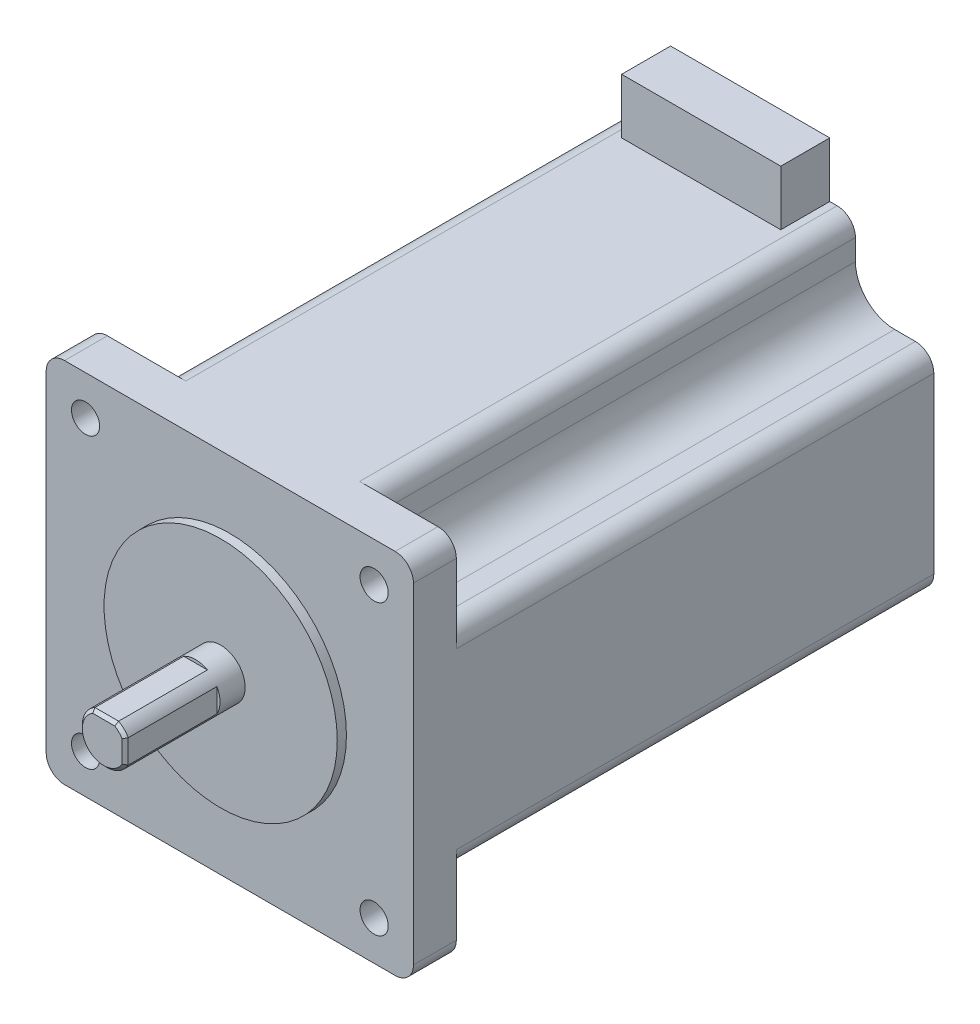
ISO-10303-21;
HEADER;
FILE_DESCRIPTION(('STEP AP214'),'2;1');
FILE_NAME('part.step','',(''),(''),'','','');
FILE_SCHEMA(('AUTOMOTIVE_DESIGN { 1 0 10303 214 1 1 1 1 }'));
ENDSEC;
DATA;
#1=APPLICATION_CONTEXT('core data for automotive mechanical design processes');
#2=APPLICATION_PROTOCOL_DEFINITION('international standard','automotive_design',2000,#1);
#3=PRODUCT_CONTEXT('',#1,'mechanical');
#4=PRODUCT('Part','Part','',(#3));
#5=PRODUCT_RELATED_PRODUCT_CATEGORY('part','',(#4));
#6=PRODUCT_DEFINITION_FORMATION('','',#4);
#7=PRODUCT_DEFINITION_CONTEXT('part definition',#1,'design');
#8=PRODUCT_DEFINITION('design','',#6,#7);
#9=PRODUCT_DEFINITION_SHAPE('','',#8);
#10=(LENGTH_UNIT() NAMED_UNIT(*) SI_UNIT(.MILLI.,.METRE.));
#11=(NAMED_UNIT(*) PLANE_ANGLE_UNIT() SI_UNIT($,.RADIAN.));
#12=(NAMED_UNIT(*) SI_UNIT($,.STERADIAN.) SOLID_ANGLE_UNIT());
#13=UNCERTAINTY_MEASURE_WITH_UNIT(LENGTH_MEASURE(1.E-05),#10,'distance_accuracy_value','');
#14=(GEOMETRIC_REPRESENTATION_CONTEXT(3) GLOBAL_UNCERTAINTY_ASSIGNED_CONTEXT((#13)) GLOBAL_UNIT_ASSIGNED_CONTEXT((#10,
#11,#12)) REPRESENTATION_CONTEXT('',''));
#15=CARTESIAN_POINT('',(0.,0.,0.));
#16=DIRECTION('',(0.,0.,1.));
#17=DIRECTION('',(1.,0.,0.));
#18=AXIS2_PLACEMENT_3D('',#15,#16,#17);
#19=CARTESIAN_POINT('',(13.,39.,-78.5));
#20=DIRECTION('',(1.,0.,0.));
#21=DIRECTION('',(0.,0.,-1.));
#22=AXIS2_PLACEMENT_3D('',#19,#20,#21);
#23=PLANE('',#22);
#24=DIRECTION('',(0.,-1.,0.));
#25=VECTOR('',#24,1.);
#26=CARTESIAN_POINT('',(13.,39.,-86.5));
#27=LINE('',#26,#25);
#28=CARTESIAN_POINT('',(13.,39.,-86.5));
#29=VERTEX_POINT('',#28);
#30=CARTESIAN_POINT('',(13.,30.,-86.5));
#31=VERTEX_POINT('',#30);
#32=EDGE_CURVE('E106',#29,#31,#27,.T.);
#33=ORIENTED_EDGE('',*,*,#32,.F.);
#34=DIRECTION('',(0.,0.,-1.));
#35=VECTOR('',#34,1.);
#36=CARTESIAN_POINT('',(13.,39.,-78.5));
#37=LINE('',#36,#35);
#38=CARTESIAN_POINT('',(13.,39.,-78.5));
#39=VERTEX_POINT('',#38);
#40=EDGE_CURVE('E55',#39,#29,#37,.T.);
#41=ORIENTED_EDGE('',*,*,#40,.F.);
#42=DIRECTION('',(0.,-1.,0.));
#43=VECTOR('',#42,1.);
#44=CARTESIAN_POINT('',(13.,39.,-78.5));
#45=LINE('',#44,#43);
#46=CARTESIAN_POINT('',(13.,30.,-78.5));
#47=VERTEX_POINT('',#46);
#48=EDGE_CURVE('E102',#39,#47,#45,.T.);
#49=ORIENTED_EDGE('',*,*,#48,.T.);
#50=DIRECTION('',(0.,0.,-1.));
#51=VECTOR('',#50,1.);
#52=CARTESIAN_POINT('',(13.,30.,-78.5));
#53=LINE('',#52,#51);
#54=EDGE_CURVE('E12',#47,#31,#53,.T.);
#55=ORIENTED_EDGE('',*,*,#54,.T.);
#56=EDGE_LOOP('',(#33,#41,#49,#55));
#57=FACE_BOUND('',#56,.T.);
#58=ADVANCED_FACE('F45',(#57),#23,.T.);
#59=CARTESIAN_POINT('',(-13.,39.,-78.5));
#60=DIRECTION('',(0.,1.,0.));
#61=DIRECTION('',(0.,0.,1.));
#62=AXIS2_PLACEMENT_3D('',#59,#60,#61);
#63=PLANE('',#62);
#64=DIRECTION('',(1.,0.,0.));
#65=VECTOR('',#64,1.);
#66=CARTESIAN_POINT('',(-13.,39.,-86.5));
#67=LINE('',#66,#65);
#68=CARTESIAN_POINT('',(-13.,39.,-86.5));
#69=VERTEX_POINT('',#68);
#70=EDGE_CURVE('E92',#69,#29,#67,.T.);
#71=ORIENTED_EDGE('',*,*,#70,.F.);
#72=DIRECTION('',(0.,0.,-1.));
#73=VECTOR('',#72,1.);
#74=CARTESIAN_POINT('',(-13.,39.,-78.5));
#75=LINE('',#74,#73);
#76=CARTESIAN_POINT('',(-13.,39.,-78.5));
#77=VERTEX_POINT('',#76);
#78=EDGE_CURVE('E87',#77,#69,#75,.T.);
#79=ORIENTED_EDGE('',*,*,#78,.F.);
#80=DIRECTION('',(1.,0.,0.));
#81=VECTOR('',#80,1.);
#82=CARTESIAN_POINT('',(-13.,39.,-78.5));
#83=LINE('',#82,#81);
#84=EDGE_CURVE('E90',#77,#39,#83,.T.);
#85=ORIENTED_EDGE('',*,*,#84,.T.);
#86=ORIENTED_EDGE('',*,*,#40,.T.);
#87=EDGE_LOOP('',(#71,#79,#85,#86));
#88=FACE_BOUND('',#87,.T.);
#89=ADVANCED_FACE('F89',(#88),#63,.T.);
#90=CARTESIAN_POINT('',(-13.,30.,-78.5));
#91=DIRECTION('',(-1.,0.,0.));
#92=DIRECTION('',(0.,0.,1.));
#93=AXIS2_PLACEMENT_3D('',#90,#91,#92);
#94=PLANE('',#93);
#95=DIRECTION('',(0.,1.,0.));
#96=VECTOR('',#95,1.);
#97=CARTESIAN_POINT('',(-13.,30.,-86.5));
#98=LINE('',#97,#96);
#99=CARTESIAN_POINT('',(-13.,30.,-86.5));
#100=VERTEX_POINT('',#99);
#101=EDGE_CURVE('E111',#100,#69,#98,.T.);
#102=ORIENTED_EDGE('',*,*,#101,.F.);
#103=DIRECTION('',(0.,0.,-1.));
#104=VECTOR('',#103,1.);
#105=CARTESIAN_POINT('',(-13.,30.,-78.5));
#106=LINE('',#105,#104);
#107=CARTESIAN_POINT('',(-13.,30.,-78.5));
#108=VERTEX_POINT('',#107);
#109=EDGE_CURVE('E49',#108,#100,#106,.T.);
#110=ORIENTED_EDGE('',*,*,#109,.F.);
#111=DIRECTION('',(0.,1.,0.));
#112=VECTOR('',#111,1.);
#113=CARTESIAN_POINT('',(-13.,30.,-78.5));
#114=LINE('',#113,#112);
#115=EDGE_CURVE('E100',#108,#77,#114,.T.);
#116=ORIENTED_EDGE('',*,*,#115,.T.);
#117=ORIENTED_EDGE('',*,*,#78,.T.);
#118=EDGE_LOOP('',(#102,#110,#116,#117));
#119=FACE_BOUND('',#118,.T.);
#120=ADVANCED_FACE('F104',(#119),#94,.T.);
#121=CARTESIAN_POINT('',(0.,30.,-78.5));
#122=DIRECTION('',(0.,-1.,0.));
#123=DIRECTION('',(1.,0.,0.));
#124=AXIS2_PLACEMENT_3D('',#121,#122,#123);
#125=PLANE('',#124);
#126=DIRECTION('',(-1.,0.,0.));
#127=VECTOR('',#126,1.);
#128=CARTESIAN_POINT('',(0.,30.,-86.5));
#129=LINE('',#128,#127);
#130=EDGE_CURVE('E82',#31,#100,#129,.T.);
#131=ORIENTED_EDGE('',*,*,#130,.F.);
#132=ORIENTED_EDGE('',*,*,#54,.F.);
#133=DIRECTION('',(-1.,0.,0.));
#134=VECTOR('',#133,1.);
#135=CARTESIAN_POINT('',(13.,30.,-78.5));
#136=LINE('',#135,#134);
#137=EDGE_CURVE('E84',#47,#108,#136,.T.);
#138=ORIENTED_EDGE('',*,*,#137,.T.);
#139=ORIENTED_EDGE('',*,*,#109,.T.);
#140=EDGE_LOOP('',(#131,#132,#138,#139));
#141=FACE_BOUND('',#140,.T.);
#142=ADVANCED_FACE('F47',(#141),#125,.T.);
#143=CARTESIAN_POINT('',(0.,0.,-78.5));
#144=DIRECTION('',(0.,0.,-1.));
#145=DIRECTION('',(-1.,0.,0.));
#146=AXIS2_PLACEMENT_3D('',#143,#144,#145);
#147=PLANE('',#146);
#148=ORIENTED_EDGE('',*,*,#137,.F.);
#149=ORIENTED_EDGE('',*,*,#48,.F.);
#150=ORIENTED_EDGE('',*,*,#84,.F.);
#151=ORIENTED_EDGE('',*,*,#115,.F.);
#152=EDGE_LOOP('',(#148,#149,#150,#151));
#153=FACE_BOUND('',#152,.T.);
#154=ADVANCED_FACE('F99',(#153),#147,.F.);
#155=CARTESIAN_POINT('',(0.,0.,-86.5));
#156=DIRECTION('',(0.,0.,-1.));
#157=DIRECTION('',(-1.,0.,0.));
#158=AXIS2_PLACEMENT_3D('',#155,#156,#157);
#159=PLANE('',#158);
#160=ORIENTED_EDGE('',*,*,#32,.T.);
#161=ORIENTED_EDGE('',*,*,#130,.T.);
#162=ORIENTED_EDGE('',*,*,#101,.T.);
#163=ORIENTED_EDGE('',*,*,#70,.T.);
#164=EDGE_LOOP('',(#160,#161,#162,#163));
#165=FACE_BOUND('',#164,.T.);
#166=ADVANCED_FACE('F118',(#165),#159,.T.);
#167=CLOSED_SHELL('',(#58,#89,#120,#142,#154,#166));
#168=MANIFOLD_SOLID_BREP('B2',#167);
#169=CARTESIAN_POINT('',(27.,-27.,-86.5));
#170=DIRECTION('',(0.,0.,1.));
#171=DIRECTION('',(1.,0.,0.));
#172=AXIS2_PLACEMENT_3D('',#169,#170,#171);
#173=CYLINDRICAL_SURFACE('',#172,3.);
#174=CARTESIAN_POINT('',(27.,-27.,-8.50000000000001));
#175=DIRECTION('',(0.,0.,-1.));
#176=DIRECTION('',(-1.,0.,0.));
#177=AXIS2_PLACEMENT_3D('',#174,#175,#176);
#178=CIRCLE('',#177,3.);
#179=CARTESIAN_POINT('',(30.,-27.,-8.50000000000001));
#180=VERTEX_POINT('',#179);
#181=CARTESIAN_POINT('',(27.,-30.,-8.50000000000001));
#182=VERTEX_POINT('',#181);
#183=EDGE_CURVE('E470',#180,#182,#178,.T.);
#184=ORIENTED_EDGE('',*,*,#183,.F.);
#185=DIRECTION('',(0.,0.,1.));
#186=VECTOR('',#185,1.);
#187=CARTESIAN_POINT('',(30.,-27.,-86.5));
#188=LINE('',#187,#186);
#189=CARTESIAN_POINT('',(30.,-27.,-1.5));
#190=VERTEX_POINT('',#189);
#191=EDGE_CURVE('E645',#180,#190,#188,.T.);
#192=ORIENTED_EDGE('',*,*,#191,.T.);
#193=CARTESIAN_POINT('',(27.,-27.,-1.5));
#194=DIRECTION('',(0.,0.,-1.));
#195=DIRECTION('',(1.,0.,0.));
#196=AXIS2_PLACEMENT_3D('',#193,#194,#195);
#197=CIRCLE('',#196,3.);
#198=CARTESIAN_POINT('',(27.,-30.,-1.5));
#199=VERTEX_POINT('',#198);
#200=EDGE_CURVE('E635',#190,#199,#197,.T.);
#201=ORIENTED_EDGE('',*,*,#200,.T.);
#202=DIRECTION('',(0.,0.,1.));
#203=VECTOR('',#202,1.);
#204=CARTESIAN_POINT('',(27.,-30.,-86.5));
#205=LINE('',#204,#203);
#206=EDGE_CURVE('E681',#182,#199,#205,.T.);
#207=ORIENTED_EDGE('',*,*,#206,.F.);
#208=EDGE_LOOP('',(#184,#192,#201,#207));
#209=FACE_BOUND('',#208,.T.);
#210=ADVANCED_FACE('F172',(#209),#173,.T.);
#211=CARTESIAN_POINT('',(23.57,-23.57,-86.5));
#212=DIRECTION('',(0.,0.,1.));
#213=DIRECTION('',(1.,0.,0.));
#214=AXIS2_PLACEMENT_3D('',#211,#212,#213);
#215=CYLINDRICAL_SURFACE('',#214,2.3);
#216=CARTESIAN_POINT('',(23.57,-23.57,-1.5));
#217=DIRECTION('',(0.,0.,-1.));
#218=DIRECTION('',(-1.,0.,0.));
#219=AXIS2_PLACEMENT_3D('',#216,#217,#218);
#220=CIRCLE('',#219,2.3);
#221=CARTESIAN_POINT('',(21.27,-23.57,-1.5));
#222=VERTEX_POINT('',#221);
#223=EDGE_CURVE('E626',#222,#222,#220,.T.);
#224=ORIENTED_EDGE('',*,*,#223,.F.);
#225=EDGE_LOOP('',(#224));
#226=FACE_BOUND('',#225,.T.);
#227=CARTESIAN_POINT('',(23.57,-23.57,-8.50000000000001));
#228=DIRECTION('',(0.,0.,-1.));
#229=DIRECTION('',(-1.,0.,0.));
#230=AXIS2_PLACEMENT_3D('',#227,#228,#229);
#231=CIRCLE('',#230,2.3);
#232=CARTESIAN_POINT('',(21.27,-23.57,-8.50000000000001));
#233=VERTEX_POINT('',#232);
#234=EDGE_CURVE('E177',#233,#233,#231,.T.);
#235=ORIENTED_EDGE('',*,*,#234,.T.);
#236=EDGE_LOOP('',(#235));
#237=FACE_BOUND('',#236,.T.);
#238=ADVANCED_FACE('F894',(#226,#237),#215,.F.);
#239=CARTESIAN_POINT('',(-27.,-27.,-86.5));
#240=DIRECTION('',(0.,0.,1.));
#241=DIRECTION('',(1.,0.,0.));
#242=AXIS2_PLACEMENT_3D('',#239,#240,#241);
#243=CYLINDRICAL_SURFACE('',#242,3.);
#244=CARTESIAN_POINT('',(-27.,-27.,-8.50000000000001));
#245=DIRECTION('',(0.,0.,-1.));
#246=DIRECTION('',(-1.,0.,0.));
#247=AXIS2_PLACEMENT_3D('',#244,#245,#246);
#248=CIRCLE('',#247,3.);
#249=CARTESIAN_POINT('',(-27.,-30.,-8.50000000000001));
#250=VERTEX_POINT('',#249);
#251=CARTESIAN_POINT('',(-30.,-27.,-8.50000000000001));
#252=VERTEX_POINT('',#251);
#253=EDGE_CURVE('E198',#250,#252,#248,.T.);
#254=ORIENTED_EDGE('',*,*,#253,.F.);
#255=DIRECTION('',(0.,0.,1.));
#256=VECTOR('',#255,1.);
#257=CARTESIAN_POINT('',(-27.,-30.,-86.5));
#258=LINE('',#257,#256);
#259=CARTESIAN_POINT('',(-27.,-30.,-1.5));
#260=VERTEX_POINT('',#259);
#261=EDGE_CURVE('E679',#250,#260,#258,.T.);
#262=ORIENTED_EDGE('',*,*,#261,.T.);
#263=CARTESIAN_POINT('',(-27.,-27.,-1.5));
#264=DIRECTION('',(0.,0.,-1.));
#265=DIRECTION('',(1.,0.,0.));
#266=AXIS2_PLACEMENT_3D('',#263,#264,#265);
#267=CIRCLE('',#266,3.);
#268=CARTESIAN_POINT('',(-30.,-27.,-1.5));
#269=VERTEX_POINT('',#268);
#270=EDGE_CURVE('E651',#260,#269,#267,.T.);
#271=ORIENTED_EDGE('',*,*,#270,.T.);
#272=DIRECTION('',(0.,0.,1.));
#273=VECTOR('',#272,1.);
#274=CARTESIAN_POINT('',(-30.,-27.,-86.5));
#275=LINE('',#274,#273);
#276=EDGE_CURVE('E677',#252,#269,#275,.T.);
#277=ORIENTED_EDGE('',*,*,#276,.F.);
#278=EDGE_LOOP('',(#254,#262,#271,#277));
#279=FACE_BOUND('',#278,.T.);
#280=ADVANCED_FACE('F785',(#279),#243,.T.);
#281=CARTESIAN_POINT('',(-23.57,-23.57,-86.5));
#282=DIRECTION('',(0.,0.,1.));
#283=DIRECTION('',(1.,0.,0.));
#284=AXIS2_PLACEMENT_3D('',#281,#282,#283);
#285=CYLINDRICAL_SURFACE('',#284,2.3);
#286=CARTESIAN_POINT('',(-23.57,-23.57,-1.5));
#287=DIRECTION('',(0.,0.,-1.));
#288=DIRECTION('',(-1.,0.,0.));
#289=AXIS2_PLACEMENT_3D('',#286,#287,#288);
#290=CIRCLE('',#289,2.3);
#291=CARTESIAN_POINT('',(-25.87,-23.57,-1.5));
#292=VERTEX_POINT('',#291);
#293=EDGE_CURVE('E629',#292,#292,#290,.T.);
#294=ORIENTED_EDGE('',*,*,#293,.F.);
#295=EDGE_LOOP('',(#294));
#296=FACE_BOUND('',#295,.T.);
#297=CARTESIAN_POINT('',(-23.57,-23.57,-8.50000000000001));
#298=DIRECTION('',(0.,0.,-1.));
#299=DIRECTION('',(-1.,0.,0.));
#300=AXIS2_PLACEMENT_3D('',#297,#298,#299);
#301=CIRCLE('',#300,2.3);
#302=CARTESIAN_POINT('',(-25.87,-23.57,-8.50000000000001));
#303=VERTEX_POINT('',#302);
#304=EDGE_CURVE('E507',#303,#303,#301,.T.);
#305=ORIENTED_EDGE('',*,*,#304,.T.);
#306=EDGE_LOOP('',(#305));
#307=FACE_BOUND('',#306,.T.);
#308=ADVANCED_FACE('F772',(#296,#307),#285,.F.);
#309=CARTESIAN_POINT('',(27.,27.,-86.5));
#310=DIRECTION('',(0.,0.,1.));
#311=DIRECTION('',(1.,0.,0.));
#312=AXIS2_PLACEMENT_3D('',#309,#310,#311);
#313=CYLINDRICAL_SURFACE('',#312,3.);
#314=CARTESIAN_POINT('',(27.,27.,-8.50000000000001));
#315=DIRECTION('',(0.,0.,-1.));
#316=DIRECTION('',(-1.,0.,0.));
#317=AXIS2_PLACEMENT_3D('',#314,#315,#316);
#318=CIRCLE('',#317,3.);
#319=CARTESIAN_POINT('',(27.,30.,-8.50000000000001));
#320=VERTEX_POINT('',#319);
#321=CARTESIAN_POINT('',(30.,27.,-8.50000000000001));
#322=VERTEX_POINT('',#321);
#323=EDGE_CURVE('E569',#320,#322,#318,.T.);
#324=ORIENTED_EDGE('',*,*,#323,.F.);
#325=DIRECTION('',(0.,0.,1.));
#326=VECTOR('',#325,1.);
#327=CARTESIAN_POINT('',(27.,30.,-86.5));
#328=LINE('',#327,#326);
#329=CARTESIAN_POINT('',(27.,30.,-1.5));
#330=VERTEX_POINT('',#329);
#331=EDGE_CURVE('E671',#320,#330,#328,.T.);
#332=ORIENTED_EDGE('',*,*,#331,.T.);
#333=CARTESIAN_POINT('',(27.,27.,-1.5));
#334=DIRECTION('',(0.,0.,-1.));
#335=DIRECTION('',(1.,0.,0.));
#336=AXIS2_PLACEMENT_3D('',#333,#334,#335);
#337=CIRCLE('',#336,3.);
#338=CARTESIAN_POINT('',(30.,27.,-1.5));
#339=VERTEX_POINT('',#338);
#340=EDGE_CURVE('E663',#330,#339,#337,.T.);
#341=ORIENTED_EDGE('',*,*,#340,.T.);
#342=DIRECTION('',(0.,0.,1.));
#343=VECTOR('',#342,1.);
#344=CARTESIAN_POINT('',(30.,27.,-86.5));
#345=LINE('',#344,#343);
#346=EDGE_CURVE('E669',#322,#339,#345,.T.);
#347=ORIENTED_EDGE('',*,*,#346,.F.);
#348=EDGE_LOOP('',(#324,#332,#341,#347));
#349=FACE_BOUND('',#348,.T.);
#350=ADVANCED_FACE('F848',(#349),#313,.T.);
#351=CARTESIAN_POINT('',(23.57,23.57,-86.5));
#352=DIRECTION('',(0.,0.,1.));
#353=DIRECTION('',(1.,0.,0.));
#354=AXIS2_PLACEMENT_3D('',#351,#352,#353);
#355=CYLINDRICAL_SURFACE('',#354,2.3);
#356=CARTESIAN_POINT('',(23.57,23.57,-1.5));
#357=DIRECTION('',(0.,0.,-1.));
#358=DIRECTION('',(-1.,0.,0.));
#359=AXIS2_PLACEMENT_3D('',#356,#357,#358);
#360=CIRCLE('',#359,2.3);
#361=CARTESIAN_POINT('',(21.27,23.57,-1.5));
#362=VERTEX_POINT('',#361);
#363=EDGE_CURVE('E623',#362,#362,#360,.T.);
#364=ORIENTED_EDGE('',*,*,#363,.F.);
#365=EDGE_LOOP('',(#364));
#366=FACE_BOUND('',#365,.T.);
#367=CARTESIAN_POINT('',(23.57,23.57,-8.50000000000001));
#368=DIRECTION('',(0.,0.,-1.));
#369=DIRECTION('',(-1.,0.,0.));
#370=AXIS2_PLACEMENT_3D('',#367,#368,#369);
#371=CIRCLE('',#370,2.3);
#372=CARTESIAN_POINT('',(21.27,23.57,-8.50000000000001));
#373=VERTEX_POINT('',#372);
#374=EDGE_CURVE('E556',#373,#373,#371,.T.);
#375=ORIENTED_EDGE('',*,*,#374,.T.);
#376=EDGE_LOOP('',(#375));
#377=FACE_BOUND('',#376,.T.);
#378=ADVANCED_FACE('F977',(#366,#377),#355,.F.);
#379=CARTESIAN_POINT('',(-27.,27.,-86.5));
#380=DIRECTION('',(0.,0.,1.));
#381=DIRECTION('',(1.,0.,0.));
#382=AXIS2_PLACEMENT_3D('',#379,#380,#381);
#383=CYLINDRICAL_SURFACE('',#382,3.);
#384=CARTESIAN_POINT('',(-27.,27.,-8.50000000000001));
#385=DIRECTION('',(0.,0.,-1.));
#386=DIRECTION('',(-1.,0.,0.));
#387=AXIS2_PLACEMENT_3D('',#384,#385,#386);
#388=CIRCLE('',#387,3.);
#389=CARTESIAN_POINT('',(-30.,27.,-8.50000000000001));
#390=VERTEX_POINT('',#389);
#391=CARTESIAN_POINT('',(-27.,30.,-8.50000000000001));
#392=VERTEX_POINT('',#391);
#393=EDGE_CURVE('E619',#390,#392,#388,.T.);
#394=ORIENTED_EDGE('',*,*,#393,.F.);
#395=DIRECTION('',(0.,0.,1.));
#396=VECTOR('',#395,1.);
#397=CARTESIAN_POINT('',(-30.,27.,-86.5));
#398=LINE('',#397,#396);
#399=CARTESIAN_POINT('',(-30.,27.,-1.5));
#400=VERTEX_POINT('',#399);
#401=EDGE_CURVE('E675',#390,#400,#398,.T.);
#402=ORIENTED_EDGE('',*,*,#401,.T.);
#403=CARTESIAN_POINT('',(-27.,27.,-1.5));
#404=DIRECTION('',(0.,0.,-1.));
#405=DIRECTION('',(1.,0.,0.));
#406=AXIS2_PLACEMENT_3D('',#403,#404,#405);
#407=CIRCLE('',#406,3.);
#408=CARTESIAN_POINT('',(-27.,30.,-1.5));
#409=VERTEX_POINT('',#408);
#410=EDGE_CURVE('E657',#400,#409,#407,.T.);
#411=ORIENTED_EDGE('',*,*,#410,.T.);
#412=DIRECTION('',(0.,0.,1.));
#413=VECTOR('',#412,1.);
#414=CARTESIAN_POINT('',(-27.,30.,-86.5));
#415=LINE('',#414,#413);
#416=EDGE_CURVE('E673',#392,#409,#415,.T.);
#417=ORIENTED_EDGE('',*,*,#416,.F.);
#418=EDGE_LOOP('',(#394,#402,#411,#417));
#419=FACE_BOUND('',#418,.T.);
#420=ADVANCED_FACE('F857',(#419),#383,.T.);
#421=CARTESIAN_POINT('',(-23.57,23.57,-86.5));
#422=DIRECTION('',(0.,0.,1.));
#423=DIRECTION('',(1.,0.,0.));
#424=AXIS2_PLACEMENT_3D('',#421,#422,#423);
#425=CYLINDRICAL_SURFACE('',#424,2.3);
#426=CARTESIAN_POINT('',(-23.57,23.57,-1.5));
#427=DIRECTION('',(0.,0.,-1.));
#428=DIRECTION('',(-1.,0.,0.));
#429=AXIS2_PLACEMENT_3D('',#426,#427,#428);
#430=CIRCLE('',#429,2.3);
#431=CARTESIAN_POINT('',(-25.87,23.57,-1.5));
#432=VERTEX_POINT('',#431);
#433=EDGE_CURVE('E632',#432,#432,#430,.T.);
#434=ORIENTED_EDGE('',*,*,#433,.F.);
#435=EDGE_LOOP('',(#434));
#436=FACE_BOUND('',#435,.T.);
#437=CARTESIAN_POINT('',(-23.57,23.57,-8.50000000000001));
#438=DIRECTION('',(0.,0.,-1.));
#439=DIRECTION('',(-1.,0.,0.));
#440=AXIS2_PLACEMENT_3D('',#437,#438,#439);
#441=CIRCLE('',#440,2.3);
#442=CARTESIAN_POINT('',(-25.87,23.57,-8.50000000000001));
#443=VERTEX_POINT('',#442);
#444=EDGE_CURVE('E606',#443,#443,#441,.T.);
#445=ORIENTED_EDGE('',*,*,#444,.T.);
#446=EDGE_LOOP('',(#445));
#447=FACE_BOUND('',#446,.T.);
#448=ADVANCED_FACE('F931',(#436,#447),#425,.F.);
#449=CARTESIAN_POINT('',(0.,0.,0.));
#450=DIRECTION('',(0.,0.,1.));
#451=DIRECTION('',(1.,0.,0.));
#452=AXIS2_PLACEMENT_3D('',#449,#450,#451);
#453=PLANE('',#452);
#454=CARTESIAN_POINT('',(0.,0.,0.));
#455=DIRECTION('',(0.,0.,1.));
#456=DIRECTION('',(1.,0.,0.));
#457=AXIS2_PLACEMENT_3D('',#454,#455,#456);
#458=CIRCLE('',#457,19.05);
#459=CARTESIAN_POINT('',(19.05,0.,0.));
#460=VERTEX_POINT('',#459);
#461=EDGE_CURVE('E707',#460,#460,#458,.T.);
#462=ORIENTED_EDGE('',*,*,#461,.T.);
#463=EDGE_LOOP('',(#462));
#464=FACE_BOUND('',#463,.T.);
#465=CARTESIAN_POINT('',(0.,0.,0.));
#466=DIRECTION('',(0.,0.,1.));
#467=DIRECTION('',(1.,0.,0.));
#468=AXIS2_PLACEMENT_3D('',#465,#466,#467);
#469=CIRCLE('',#468,4.);
#470=CARTESIAN_POINT('',(4.,0.,0.));
#471=VERTEX_POINT('',#470);
#472=EDGE_CURVE('E704',#471,#471,#469,.T.);
#473=ORIENTED_EDGE('',*,*,#472,.F.);
#474=EDGE_LOOP('',(#473));
#475=FACE_BOUND('',#474,.T.);
#476=ADVANCED_FACE('F929',(#464,#475),#453,.T.);
#477=CARTESIAN_POINT('',(0.,0.,-1.5));
#478=DIRECTION('',(0.,0.,1.));
#479=DIRECTION('',(1.,0.,0.));
#480=AXIS2_PLACEMENT_3D('',#477,#478,#479);
#481=CYLINDRICAL_SURFACE('',#480,19.05);
#482=CARTESIAN_POINT('',(0.,0.,-1.5));
#483=DIRECTION('',(0.,0.,1.));
#484=DIRECTION('',(1.,0.,0.));
#485=AXIS2_PLACEMENT_3D('',#482,#483,#484);
#486=CIRCLE('',#485,19.05);
#487=CARTESIAN_POINT('',(19.05,0.,-1.5));
#488=VERTEX_POINT('',#487);
#489=EDGE_CURVE('E683',#488,#488,#486,.F.);
#490=ORIENTED_EDGE('',*,*,#489,.F.);
#491=EDGE_LOOP('',(#490));
#492=FACE_BOUND('',#491,.T.);
#493=ORIENTED_EDGE('',*,*,#461,.F.);
#494=EDGE_LOOP('',(#493));
#495=FACE_BOUND('',#494,.T.);
#496=ADVANCED_FACE('F927',(#492,#495),#481,.T.);
#497=CARTESIAN_POINT('',(0.,0.,19.1));
#498=DIRECTION('',(0.,0.,-1.));
#499=DIRECTION('',(-1.,0.,0.));
#500=AXIS2_PLACEMENT_3D('',#497,#498,#499);
#501=CYLINDRICAL_SURFACE('',#500,4.);
#502=DIRECTION('',(0.,0.,-1.));
#503=VECTOR('',#502,1.);
#504=CARTESIAN_POINT('',(1.93649167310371,3.5,19.1));
#505=LINE('',#504,#503);
#506=CARTESIAN_POINT('',(1.93649167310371,3.5,4.1));
#507=VERTEX_POINT('',#506);
#508=CARTESIAN_POINT('',(1.93649167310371,3.5,18.6));
#509=VERTEX_POINT('',#508);
#510=EDGE_CURVE('E699',#507,#509,#505,.F.);
#511=ORIENTED_EDGE('',*,*,#510,.T.);
#512=CARTESIAN_POINT('',(0.,0.,18.6));
#513=DIRECTION('',(0.,0.,1.));
#514=DIRECTION('',(1.,0.,0.));
#515=AXIS2_PLACEMENT_3D('',#512,#513,#514);
#516=CIRCLE('',#515,4.);
#517=CARTESIAN_POINT('',(3.5,1.93649167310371,18.6));
#518=VERTEX_POINT('',#517);
#519=EDGE_CURVE('E182',#509,#518,#516,.F.);
#520=ORIENTED_EDGE('',*,*,#519,.T.);
#521=DIRECTION('',(0.,0.,-1.));
#522=VECTOR('',#521,1.);
#523=CARTESIAN_POINT('',(3.5,1.93649167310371,19.1));
#524=LINE('',#523,#522);
#525=CARTESIAN_POINT('',(3.5,1.93649167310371,4.1));
#526=VERTEX_POINT('',#525);
#527=EDGE_CURVE('E694',#518,#526,#524,.T.);
#528=ORIENTED_EDGE('',*,*,#527,.T.);
#529=CARTESIAN_POINT('',(0.,0.,4.1));
#530=DIRECTION('',(0.,0.,1.));
#531=DIRECTION('',(1.,0.,0.));
#532=AXIS2_PLACEMENT_3D('',#529,#530,#531);
#533=CIRCLE('',#532,4.);
#534=CARTESIAN_POINT('',(3.5,-1.93649167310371,4.1));
#535=VERTEX_POINT('',#534);
#536=EDGE_CURVE('E713',#535,#526,#533,.T.);
#537=ORIENTED_EDGE('',*,*,#536,.F.);
#538=DIRECTION('',(0.,0.,-1.));
#539=VECTOR('',#538,1.);
#540=CARTESIAN_POINT('',(3.5,-1.93649167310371,19.1));
#541=LINE('',#540,#539);
#542=CARTESIAN_POINT('',(3.5,-1.93649167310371,18.6));
#543=VERTEX_POINT('',#542);
#544=EDGE_CURVE('E690',#535,#543,#541,.F.);
#545=ORIENTED_EDGE('',*,*,#544,.T.);
#546=CARTESIAN_POINT('',(0.,0.,18.6));
#547=DIRECTION('',(0.,0.,1.));
#548=DIRECTION('',(1.,0.,0.));
#549=AXIS2_PLACEMENT_3D('',#546,#547,#548);
#550=CIRCLE('',#549,4.);
#551=CARTESIAN_POINT('',(-1.93649167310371,3.5,18.6));
#552=VERTEX_POINT('',#551);
#553=EDGE_CURVE('E728',#543,#552,#550,.F.);
#554=ORIENTED_EDGE('',*,*,#553,.T.);
#555=DIRECTION('',(0.,0.,-1.));
#556=VECTOR('',#555,1.);
#557=CARTESIAN_POINT('',(-1.93649167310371,3.5,19.1));
#558=LINE('',#557,#556);
#559=CARTESIAN_POINT('',(-1.93649167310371,3.5,4.1));
#560=VERTEX_POINT('',#559);
#561=EDGE_CURVE('E702',#552,#560,#558,.T.);
#562=ORIENTED_EDGE('',*,*,#561,.T.);
#563=CARTESIAN_POINT('',(0.,0.,4.1));
#564=DIRECTION('',(0.,0.,1.));
#565=DIRECTION('',(1.,0.,0.));
#566=AXIS2_PLACEMENT_3D('',#563,#564,#565);
#567=CIRCLE('',#566,4.);
#568=EDGE_CURVE('E710',#507,#560,#567,.T.);
#569=ORIENTED_EDGE('',*,*,#568,.F.);
#570=EDGE_LOOP('',(#511,#520,#528,#537,#545,#554,#562,#569));
#571=FACE_BOUND('',#570,.T.);
#572=ORIENTED_EDGE('',*,*,#472,.T.);
#573=EDGE_LOOP('',(#572));
#574=FACE_BOUND('',#573,.T.);
#575=ADVANCED_FACE('F923',(#571,#574),#501,.T.);
#576=CARTESIAN_POINT('',(0.,0.,19.1));
#577=DIRECTION('',(0.,0.,1.));
#578=DIRECTION('',(1.,0.,0.));
#579=AXIS2_PLACEMENT_3D('',#576,#577,#578);
#580=PLANE('',#579);
#581=CARTESIAN_POINT('',(0.,0.,19.1));
#582=DIRECTION('',(0.,0.,1.));
#583=DIRECTION('',(1.,0.,0.));
#584=AXIS2_PLACEMENT_3D('',#581,#582,#583);
#585=CIRCLE('',#584,3.49999999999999);
#586=CARTESIAN_POINT('',(2.99999999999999,1.8027756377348,19.1));
#587=VERTEX_POINT('',#586);
#588=CARTESIAN_POINT('',(1.8027756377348,2.99999999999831,19.1));
#589=VERTEX_POINT('',#588);
#590=EDGE_CURVE('E723',#587,#589,#585,.T.);
#591=ORIENTED_EDGE('',*,*,#590,.T.);
#592=DIRECTION('',(-1.,0.,0.));
#593=VECTOR('',#592,1.);
#594=CARTESIAN_POINT('',(-1.93649167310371,2.99999999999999,19.1));
#595=LINE('',#594,#593);
#596=CARTESIAN_POINT('',(-1.8027756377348,2.99999999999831,19.1));
#597=VERTEX_POINT('',#596);
#598=EDGE_CURVE('E725',#589,#597,#595,.T.);
#599=ORIENTED_EDGE('',*,*,#598,.T.);
#600=CARTESIAN_POINT('',(0.,0.,19.1));
#601=DIRECTION('',(0.,0.,1.));
#602=DIRECTION('',(1.,0.,0.));
#603=AXIS2_PLACEMENT_3D('',#600,#601,#602);
#604=CIRCLE('',#603,3.49999999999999);
#605=CARTESIAN_POINT('',(2.99999999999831,-1.8027756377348,19.1));
#606=VERTEX_POINT('',#605);
#607=EDGE_CURVE('E719',#597,#606,#604,.T.);
#608=ORIENTED_EDGE('',*,*,#607,.T.);
#609=DIRECTION('',(0.,1.,0.));
#610=VECTOR('',#609,1.);
#611=CARTESIAN_POINT('',(2.99999999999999,1.93649167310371,19.1));
#612=LINE('',#611,#610);
#613=EDGE_CURVE('E721',#606,#587,#612,.T.);
#614=ORIENTED_EDGE('',*,*,#613,.T.);
#615=EDGE_LOOP('',(#591,#599,#608,#614));
#616=FACE_BOUND('',#615,.T.);
#617=ADVANCED_FACE('F916',(#616),#580,.T.);
#618=CARTESIAN_POINT('',(0.,0.,4.1));
#619=DIRECTION('',(0.,0.,1.));
#620=DIRECTION('',(1.,0.,0.));
#621=AXIS2_PLACEMENT_3D('',#618,#619,#620);
#622=PLANE('',#621);
#623=ORIENTED_EDGE('',*,*,#568,.T.);
#624=DIRECTION('',(1.,0.,0.));
#625=VECTOR('',#624,1.);
#626=CARTESIAN_POINT('',(-4.,3.5,4.1));
#627=LINE('',#626,#625);
#628=EDGE_CURVE('E696',#560,#507,#627,.T.);
#629=ORIENTED_EDGE('',*,*,#628,.T.);
#630=EDGE_LOOP('',(#623,#629));
#631=FACE_BOUND('',#630,.T.);
#632=ADVANCED_FACE('F913',(#631),#622,.T.);
#633=CARTESIAN_POINT('',(0.,3.5,4.1));
#634=DIRECTION('',(0.,-1.,0.));
#635=DIRECTION('',(0.,0.,-1.));
#636=AXIS2_PLACEMENT_3D('',#633,#634,#635);
#637=PLANE('',#636);
#638=ORIENTED_EDGE('',*,*,#561,.F.);
#639=DIRECTION('',(1.,0.,0.));
#640=VECTOR('',#639,1.);
#641=CARTESIAN_POINT('',(1.93649167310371,3.5,18.6));
#642=LINE('',#641,#640);
#643=EDGE_CURVE('E716',#552,#509,#642,.T.);
#644=ORIENTED_EDGE('',*,*,#643,.T.);
#645=ORIENTED_EDGE('',*,*,#510,.F.);
#646=ORIENTED_EDGE('',*,*,#628,.F.);
#647=EDGE_LOOP('',(#638,#644,#645,#646));
#648=FACE_BOUND('',#647,.T.);
#649=ADVANCED_FACE('F908',(#648),#637,.F.);
#650=CARTESIAN_POINT('',(0.,0.,4.1));
#651=DIRECTION('',(0.,0.,1.));
#652=DIRECTION('',(1.,0.,0.));
#653=AXIS2_PLACEMENT_3D('',#650,#651,#652);
#654=PLANE('',#653);
#655=ORIENTED_EDGE('',*,*,#536,.T.);
#656=DIRECTION('',(0.,-1.,0.));
#657=VECTOR('',#656,1.);
#658=CARTESIAN_POINT('',(3.5,3.5,4.1));
#659=LINE('',#658,#657);
#660=EDGE_CURVE('E687',#526,#535,#659,.T.);
#661=ORIENTED_EDGE('',*,*,#660,.T.);
#662=EDGE_LOOP('',(#655,#661));
#663=FACE_BOUND('',#662,.T.);
#664=ADVANCED_FACE('F904',(#663),#654,.T.);
#665=CARTESIAN_POINT('',(3.5,0.,4.1));
#666=DIRECTION('',(-1.,0.,0.));
#667=DIRECTION('',(0.,0.,1.));
#668=AXIS2_PLACEMENT_3D('',#665,#666,#667);
#669=PLANE('',#668);
#670=ORIENTED_EDGE('',*,*,#527,.F.);
#671=DIRECTION('',(0.,-1.,0.));
#672=VECTOR('',#671,1.);
#673=CARTESIAN_POINT('',(3.5,-1.93649167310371,18.6));
#674=LINE('',#673,#672);
#675=EDGE_CURVE('E43',#518,#543,#674,.T.);
#676=ORIENTED_EDGE('',*,*,#675,.T.);
#677=ORIENTED_EDGE('',*,*,#544,.F.);
#678=ORIENTED_EDGE('',*,*,#660,.F.);
#679=EDGE_LOOP('',(#670,#676,#677,#678));
#680=FACE_BOUND('',#679,.T.);
#681=ADVANCED_FACE('F907',(#680),#669,.F.);
#682=CARTESIAN_POINT('',(3.5,0.,18.6));
#683=DIRECTION('',(0.707106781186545,0.,0.70710678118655));
#684=DIRECTION('',(0.,1.,0.));
#685=AXIS2_PLACEMENT_3D('',#682,#683,#684);
#686=PLANE('',#685);
#687=CARTESIAN_POINT('',(3.5,1.93649167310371,18.6));
#688=CARTESIAN_POINT('',(3.41656387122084,1.91497488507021,18.6834361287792));
#689=CARTESIAN_POINT('',(3.33317916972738,1.89307349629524,18.7668208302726));
#690=CARTESIAN_POINT('',(3.16651250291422,1.84850148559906,18.9334874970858));
#691=CARTESIAN_POINT('',(3.08323053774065,1.82583086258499,19.0167694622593));
#692=CARTESIAN_POINT('',(2.99999999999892,1.80277563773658,19.1000000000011));
#693=B_SPLINE_CURVE_WITH_KNOTS('',3,(#687,#688,#689,#690,#691,#692),.UNSPECIFIED.,.F.,.F.,(4,2,
4),(0.,0.3598210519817,0.719642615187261),.UNSPECIFIED.);
#694=EDGE_CURVE('E762',#587,#518,#693,.F.);
#695=ORIENTED_EDGE('',*,*,#694,.F.);
#696=ORIENTED_EDGE('',*,*,#613,.F.);
#697=CARTESIAN_POINT('',(3.5,-1.93649167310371,18.6));
#698=CARTESIAN_POINT('',(3.416563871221,-1.91497488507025,18.683436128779));
#699=CARTESIAN_POINT('',(3.33317916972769,-1.89307349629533,18.7668208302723));
#700=CARTESIAN_POINT('',(3.16651250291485,-1.84850148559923,18.9334874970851));
#701=CARTESIAN_POINT('',(3.08323053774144,-1.8258308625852,19.0167694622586));
#702=CARTESIAN_POINT('',(2.99999999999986,-1.80277563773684,19.1000000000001));
#703=B_SPLINE_CURVE_WITH_KNOTS('',3,(#697,#698,#699,#700,#701,#702),.UNSPECIFIED.,.F.,.F.,(4,2,
4),(0.,0.359821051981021,0.719642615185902),.UNSPECIFIED.);
#704=EDGE_CURVE('E691',#543,#606,#703,.T.);
#705=ORIENTED_EDGE('',*,*,#704,.F.);
#706=ORIENTED_EDGE('',*,*,#675,.F.);
#707=EDGE_LOOP('',(#695,#696,#705,#706));
#708=FACE_BOUND('',#707,.T.);
#709=ADVANCED_FACE('F174',(#708),#686,.T.);
#710=CARTESIAN_POINT('',(0.,0.,19.1));
#711=DIRECTION('',(0.,0.,-1.));
#712=DIRECTION('',(-1.,0.,0.));
#713=AXIS2_PLACEMENT_3D('',#710,#711,#712);
#714=CONICAL_SURFACE('',#713,3.49999999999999,0.785398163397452);
#715=ORIENTED_EDGE('',*,*,#704,.T.);
#716=ORIENTED_EDGE('',*,*,#607,.F.);
#717=CARTESIAN_POINT('',(-1.80277563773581,2.99999999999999,19.1));
#718=CARTESIAN_POINT('',(-1.82583086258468,3.0832305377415,19.0167694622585));
#719=CARTESIAN_POINT('',(-1.84850148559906,3.16651250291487,18.9334874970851));
#720=CARTESIAN_POINT('',(-1.8930734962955,3.33317916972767,18.7668208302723));
#721=CARTESIAN_POINT('',(-1.91497488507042,3.41656387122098,18.683436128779));
#722=CARTESIAN_POINT('',(-1.93649167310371,3.5,18.6));
#723=B_SPLINE_CURVE_WITH_KNOTS('',3,(#717,#718,#719,#720,#721,#722),.UNSPECIFIED.,.F.,.F.,(4,2,
4),(0.,0.359821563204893,0.719642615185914),.UNSPECIFIED.);
#724=EDGE_CURVE('E737',#552,#597,#723,.F.);
#725=ORIENTED_EDGE('',*,*,#724,.F.);
#726=ORIENTED_EDGE('',*,*,#553,.F.);
#727=EDGE_LOOP('',(#715,#716,#725,#726));
#728=FACE_BOUND('',#727,.T.);
#729=ADVANCED_FACE('F750',(#728),#714,.T.);
#730=CARTESIAN_POINT('',(0.,0.,19.1));
#731=DIRECTION('',(0.,0.,-1.));
#732=DIRECTION('',(-1.,0.,0.));
#733=AXIS2_PLACEMENT_3D('',#730,#731,#732);
#734=CONICAL_SURFACE('',#733,3.49999999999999,0.785398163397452);
#735=ORIENTED_EDGE('',*,*,#694,.T.);
#736=ORIENTED_EDGE('',*,*,#519,.F.);
#737=CARTESIAN_POINT('',(1.93649167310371,3.5,18.6));
#738=CARTESIAN_POINT('',(1.91497488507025,3.416563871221,18.683436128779));
#739=CARTESIAN_POINT('',(1.89307349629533,3.33317916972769,18.7668208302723));
#740=CARTESIAN_POINT('',(1.84850148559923,3.16651250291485,18.9334874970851));
#741=CARTESIAN_POINT('',(1.8258308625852,3.08323053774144,19.0167694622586));
#742=CARTESIAN_POINT('',(1.80277563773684,2.99999999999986,19.1000000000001));
#743=B_SPLINE_CURVE_WITH_KNOTS('',3,(#737,#738,#739,#740,#741,#742),.UNSPECIFIED.,.F.,.F.,(4,2,
4),(0.,0.359821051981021,0.719642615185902),.UNSPECIFIED.);
#744=EDGE_CURVE('E686',#589,#509,#743,.F.);
#745=ORIENTED_EDGE('',*,*,#744,.F.);
#746=ORIENTED_EDGE('',*,*,#590,.F.);
#747=EDGE_LOOP('',(#735,#736,#745,#746));
#748=FACE_BOUND('',#747,.T.);
#749=ADVANCED_FACE('F742',(#748),#734,.T.);
#750=CARTESIAN_POINT('',(0.,3.5,18.6));
#751=DIRECTION('',(0.,0.707106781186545,0.70710678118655));
#752=DIRECTION('',(-1.,0.,0.));
#753=AXIS2_PLACEMENT_3D('',#750,#751,#752);
#754=PLANE('',#753);
#755=ORIENTED_EDGE('',*,*,#724,.T.);
#756=ORIENTED_EDGE('',*,*,#598,.F.);
#757=ORIENTED_EDGE('',*,*,#744,.T.);
#758=ORIENTED_EDGE('',*,*,#643,.F.);
#759=EDGE_LOOP('',(#755,#756,#757,#758));
#760=FACE_BOUND('',#759,.T.);
#761=ADVANCED_FACE('F745',(#760),#754,.T.);
#762=CARTESIAN_POINT('',(27.,-27.,-86.5));
#763=DIRECTION('',(0.,0.,1.));
#764=DIRECTION('',(1.,0.,0.));
#765=AXIS2_PLACEMENT_3D('',#762,#763,#764);
#766=PLANE('',#765);
#767=DIRECTION('',(0.,1.,0.));
#768=VECTOR('',#767,1.);
#769=CARTESIAN_POINT('',(17.2,-27.,-86.5));
#770=LINE('',#769,#768);
#771=CARTESIAN_POINT('',(17.2,-27.,-86.5));
#772=VERTEX_POINT('',#771);
#773=CARTESIAN_POINT('',(17.2,-23.6,-86.5));
#774=VERTEX_POINT('',#773);
#775=EDGE_CURVE('E440',#772,#774,#770,.T.);
#776=ORIENTED_EDGE('',*,*,#775,.F.);
#777=CARTESIAN_POINT('',(14.2,-27.,-86.5));
#778=DIRECTION('',(0.,0.,1.));
#779=DIRECTION('',(1.,0.,0.));
#780=AXIS2_PLACEMENT_3D('',#777,#778,#779);
#781=CIRCLE('',#780,2.99999999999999);
#782=CARTESIAN_POINT('',(14.2,-30.,-86.5));
#783=VERTEX_POINT('',#782);
#784=EDGE_CURVE('E443',#783,#772,#781,.T.);
#785=ORIENTED_EDGE('',*,*,#784,.F.);
#786=DIRECTION('',(-1.,0.,0.));
#787=VECTOR('',#786,1.);
#788=CARTESIAN_POINT('',(-27.,-30.,-86.5));
#789=LINE('',#788,#787);
#790=CARTESIAN_POINT('',(-14.2,-30.,-86.5));
#791=VERTEX_POINT('',#790);
#792=EDGE_CURVE('E636',#783,#791,#789,.T.);
#793=ORIENTED_EDGE('',*,*,#792,.T.);
#794=CARTESIAN_POINT('',(-14.2,-27.,-86.5));
#795=DIRECTION('',(0.,0.,1.));
#796=DIRECTION('',(-1.,0.,0.));
#797=AXIS2_PLACEMENT_3D('',#794,#795,#796);
#798=CIRCLE('',#797,3.);
#799=CARTESIAN_POINT('',(-17.2,-27.,-86.5));
#800=VERTEX_POINT('',#799);
#801=EDGE_CURVE('E474',#800,#791,#798,.T.);
#802=ORIENTED_EDGE('',*,*,#801,.F.);
#803=DIRECTION('',(0.,-1.,0.));
#804=VECTOR('',#803,1.);
#805=CARTESIAN_POINT('',(-17.2,-27.,-86.5));
#806=LINE('',#805,#804);
#807=CARTESIAN_POINT('',(-17.2,-23.6,-86.5));
#808=VERTEX_POINT('',#807);
#809=EDGE_CURVE('E479',#808,#800,#806,.T.);
#810=ORIENTED_EDGE('',*,*,#809,.F.);
#811=CARTESIAN_POINT('',(-23.6,-23.6,-86.5));
#812=DIRECTION('',(0.,0.,-1.));
#813=DIRECTION('',(1.,0.,0.));
#814=AXIS2_PLACEMENT_3D('',#811,#812,#813);
#815=CIRCLE('',#814,6.4);
#816=CARTESIAN_POINT('',(-23.6,-17.2,-86.5));
#817=VERTEX_POINT('',#816);
#818=EDGE_CURVE('E500',#817,#808,#815,.T.);
#819=ORIENTED_EDGE('',*,*,#818,.F.);
#820=DIRECTION('',(1.,0.,0.));
#821=VECTOR('',#820,1.);
#822=CARTESIAN_POINT('',(-23.6,-17.2,-86.5));
#823=LINE('',#822,#821);
#824=CARTESIAN_POINT('',(-27.,-17.2,-86.5));
#825=VERTEX_POINT('',#824);
#826=EDGE_CURVE('E497',#825,#817,#823,.T.);
#827=ORIENTED_EDGE('',*,*,#826,.F.);
#828=CARTESIAN_POINT('',(-27.,-14.2,-86.5));
#829=DIRECTION('',(0.,0.,1.));
#830=DIRECTION('',(-1.,0.,0.));
#831=AXIS2_PLACEMENT_3D('',#828,#829,#830);
#832=CIRCLE('',#831,3.);
#833=CARTESIAN_POINT('',(-30.,-14.2,-86.5));
#834=VERTEX_POINT('',#833);
#835=EDGE_CURVE('E494',#834,#825,#832,.T.);
#836=ORIENTED_EDGE('',*,*,#835,.F.);
#837=DIRECTION('',(0.,1.,0.));
#838=VECTOR('',#837,1.);
#839=CARTESIAN_POINT('',(-30.,27.,-86.5));
#840=LINE('',#839,#838);
#841=CARTESIAN_POINT('',(-30.,14.2,-86.5));
#842=VERTEX_POINT('',#841);
#843=EDGE_CURVE('E638',#834,#842,#840,.T.);
#844=ORIENTED_EDGE('',*,*,#843,.T.);
#845=CARTESIAN_POINT('',(-27.,14.2,-86.5));
#846=DIRECTION('',(0.,0.,1.));
#847=DIRECTION('',(1.,0.,0.));
#848=AXIS2_PLACEMENT_3D('',#845,#846,#847);
#849=CIRCLE('',#848,3.);
#850=CARTESIAN_POINT('',(-27.,17.2,-86.5));
#851=VERTEX_POINT('',#850);
#852=EDGE_CURVE('E596',#851,#842,#849,.T.);
#853=ORIENTED_EDGE('',*,*,#852,.F.);
#854=DIRECTION('',(-1.,0.,0.));
#855=VECTOR('',#854,1.);
#856=CARTESIAN_POINT('',(-23.6,17.2,-86.5));
#857=LINE('',#856,#855);
#858=CARTESIAN_POINT('',(-23.6,17.2,-86.5));
#859=VERTEX_POINT('',#858);
#860=EDGE_CURVE('E593',#859,#851,#857,.T.);
#861=ORIENTED_EDGE('',*,*,#860,.F.);
#862=CARTESIAN_POINT('',(-23.6,23.6,-86.5));
#863=DIRECTION('',(0.,0.,-1.));
#864=DIRECTION('',(-1.,0.,0.));
#865=AXIS2_PLACEMENT_3D('',#862,#863,#864);
#866=CIRCLE('',#865,6.4);
#867=CARTESIAN_POINT('',(-17.2,23.6,-86.5));
#868=VERTEX_POINT('',#867);
#869=EDGE_CURVE('E573',#868,#859,#866,.T.);
#870=ORIENTED_EDGE('',*,*,#869,.F.);
#871=DIRECTION('',(0.,-1.,0.));
#872=VECTOR('',#871,1.);
#873=CARTESIAN_POINT('',(-17.2,27.,-86.5));
#874=LINE('',#873,#872);
#875=CARTESIAN_POINT('',(-17.2,27.,-86.5));
#876=VERTEX_POINT('',#875);
#877=EDGE_CURVE('E578',#876,#868,#874,.T.);
#878=ORIENTED_EDGE('',*,*,#877,.F.);
#879=CARTESIAN_POINT('',(-14.2,27.,-86.5));
#880=DIRECTION('',(0.,0.,1.));
#881=DIRECTION('',(1.,0.,0.));
#882=AXIS2_PLACEMENT_3D('',#879,#880,#881);
#883=CIRCLE('',#882,3.);
#884=CARTESIAN_POINT('',(-14.2,30.,-86.5));
#885=VERTEX_POINT('',#884);
#886=EDGE_CURVE('E599',#885,#876,#883,.T.);
#887=ORIENTED_EDGE('',*,*,#886,.F.);
#888=DIRECTION('',(1.,0.,0.));
#889=VECTOR('',#888,1.);
#890=CARTESIAN_POINT('',(0.,30.,-86.5));
#891=LINE('',#890,#889);
#892=CARTESIAN_POINT('',(14.2,30.,-86.5));
#893=VERTEX_POINT('',#892);
#894=EDGE_CURVE('E641',#885,#893,#891,.T.);
#895=ORIENTED_EDGE('',*,*,#894,.T.);
#896=CARTESIAN_POINT('',(14.2,27.,-86.5));
#897=DIRECTION('',(0.,0.,1.));
#898=DIRECTION('',(-1.,0.,0.));
#899=AXIS2_PLACEMENT_3D('',#896,#897,#898);
#900=CIRCLE('',#899,2.99999999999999);
#901=CARTESIAN_POINT('',(17.2,27.,-86.5));
#902=VERTEX_POINT('',#901);
#903=EDGE_CURVE('E523',#902,#893,#900,.T.);
#904=ORIENTED_EDGE('',*,*,#903,.F.);
#905=DIRECTION('',(0.,1.,0.));
#906=VECTOR('',#905,1.);
#907=CARTESIAN_POINT('',(17.2,27.,-86.5));
#908=LINE('',#907,#906);
#909=CARTESIAN_POINT('',(17.2,23.6,-86.5));
#910=VERTEX_POINT('',#909);
#911=EDGE_CURVE('E528',#910,#902,#908,.T.);
#912=ORIENTED_EDGE('',*,*,#911,.F.);
#913=CARTESIAN_POINT('',(23.6,23.6,-86.5));
#914=DIRECTION('',(0.,0.,-1.));
#915=DIRECTION('',(1.,0.,0.));
#916=AXIS2_PLACEMENT_3D('',#913,#914,#915);
#917=CIRCLE('',#916,6.4);
#918=CARTESIAN_POINT('',(23.6,17.2,-86.5));
#919=VERTEX_POINT('',#918);
#920=EDGE_CURVE('E549',#919,#910,#917,.T.);
#921=ORIENTED_EDGE('',*,*,#920,.F.);
#922=DIRECTION('',(-1.,0.,0.));
#923=VECTOR('',#922,1.);
#924=CARTESIAN_POINT('',(23.6,17.2,-86.5));
#925=LINE('',#924,#923);
#926=CARTESIAN_POINT('',(27.,17.2,-86.5));
#927=VERTEX_POINT('',#926);
#928=EDGE_CURVE('E546',#927,#919,#925,.T.);
#929=ORIENTED_EDGE('',*,*,#928,.F.);
#930=CARTESIAN_POINT('',(27.,14.2,-86.5));
#931=DIRECTION('',(0.,0.,1.));
#932=DIRECTION('',(-1.,0.,0.));
#933=AXIS2_PLACEMENT_3D('',#930,#931,#932);
#934=CIRCLE('',#933,3.);
#935=CARTESIAN_POINT('',(30.,14.2,-86.5));
#936=VERTEX_POINT('',#935);
#937=EDGE_CURVE('E543',#936,#927,#934,.T.);
#938=ORIENTED_EDGE('',*,*,#937,.F.);
#939=DIRECTION('',(0.,-1.,0.));
#940=VECTOR('',#939,1.);
#941=CARTESIAN_POINT('',(30.,-27.,-86.5));
#942=LINE('',#941,#940);
#943=CARTESIAN_POINT('',(30.,-14.2,-86.5));
#944=VERTEX_POINT('',#943);
#945=EDGE_CURVE('E643',#936,#944,#942,.T.);
#946=ORIENTED_EDGE('',*,*,#945,.T.);
#947=CARTESIAN_POINT('',(27.,-14.2,-86.5));
#948=DIRECTION('',(0.,0.,1.));
#949=DIRECTION('',(1.,0.,0.));
#950=AXIS2_PLACEMENT_3D('',#947,#948,#949);
#951=CIRCLE('',#950,3.);
#952=CARTESIAN_POINT('',(27.,-17.2,-86.5));
#953=VERTEX_POINT('',#952);
#954=EDGE_CURVE('E453',#953,#944,#951,.T.);
#955=ORIENTED_EDGE('',*,*,#954,.F.);
#956=DIRECTION('',(1.,0.,0.));
#957=VECTOR('',#956,1.);
#958=CARTESIAN_POINT('',(23.6,-17.2,-86.5));
#959=LINE('',#958,#957);
#960=CARTESIAN_POINT('',(23.6,-17.2,-86.5));
#961=VERTEX_POINT('',#960);
#962=EDGE_CURVE('E451',#961,#953,#959,.T.);
#963=ORIENTED_EDGE('',*,*,#962,.F.);
#964=CARTESIAN_POINT('',(23.6,-23.6,-86.5));
#965=DIRECTION('',(0.,0.,-1.));
#966=DIRECTION('',(-1.,0.,0.));
#967=AXIS2_PLACEMENT_3D('',#964,#965,#966);
#968=CIRCLE('',#967,6.4);
#969=EDGE_CURVE('E427',#774,#961,#968,.T.);
#970=ORIENTED_EDGE('',*,*,#969,.F.);
#971=EDGE_LOOP('',(#776,#785,#793,#802,#810,#819,#827,#836,#844,#853,#861,#870,#878,#887,#895,
#904,#912,#921,#929,#938,#946,#955,#963,#970));
#972=FACE_BOUND('',#971,.T.);
#973=ADVANCED_FACE('F748',(#972),#766,.F.);
#974=CARTESIAN_POINT('',(27.,-27.,-1.5));
#975=DIRECTION('',(0.,0.,1.));
#976=DIRECTION('',(1.,0.,0.));
#977=AXIS2_PLACEMENT_3D('',#974,#975,#976);
#978=PLANE('',#977);
#979=ORIENTED_EDGE('',*,*,#489,.T.);
#980=EDGE_LOOP('',(#979));
#981=FACE_BOUND('',#980,.T.);
#982=ORIENTED_EDGE('',*,*,#223,.T.);
#983=EDGE_LOOP('',(#982));
#984=FACE_BOUND('',#983,.T.);
#985=ORIENTED_EDGE('',*,*,#433,.T.);
#986=EDGE_LOOP('',(#985));
#987=FACE_BOUND('',#986,.T.);
#988=ORIENTED_EDGE('',*,*,#200,.F.);
#989=DIRECTION('',(0.,-1.,0.));
#990=VECTOR('',#989,1.);
#991=CARTESIAN_POINT('',(30.,-27.,-1.5));
#992=LINE('',#991,#990);
#993=EDGE_CURVE('E639',#339,#190,#992,.T.);
#994=ORIENTED_EDGE('',*,*,#993,.F.);
#995=ORIENTED_EDGE('',*,*,#340,.F.);
#996=DIRECTION('',(1.,0.,0.));
#997=VECTOR('',#996,1.);
#998=CARTESIAN_POINT('',(27.,30.,-1.5));
#999=LINE('',#998,#997);
#1000=EDGE_CURVE('E660',#409,#330,#999,.T.);
#1001=ORIENTED_EDGE('',*,*,#1000,.F.);
#1002=ORIENTED_EDGE('',*,*,#410,.F.);
#1003=DIRECTION('',(0.,1.,0.));
#1004=VECTOR('',#1003,1.);
#1005=CARTESIAN_POINT('',(-30.,27.,-1.5));
#1006=LINE('',#1005,#1004);
#1007=EDGE_CURVE('E654',#269,#400,#1006,.T.);
#1008=ORIENTED_EDGE('',*,*,#1007,.F.);
#1009=ORIENTED_EDGE('',*,*,#270,.F.);
#1010=DIRECTION('',(-1.,0.,0.));
#1011=VECTOR('',#1010,1.);
#1012=CARTESIAN_POINT('',(-27.,-30.,-1.5));
#1013=LINE('',#1012,#1011);
#1014=EDGE_CURVE('E648',#199,#260,#1013,.T.);
#1015=ORIENTED_EDGE('',*,*,#1014,.F.);
#1016=EDGE_LOOP('',(#988,#994,#995,#1001,#1002,#1008,#1009,#1015));
#1017=FACE_BOUND('',#1016,.T.);
#1018=ORIENTED_EDGE('',*,*,#293,.T.);
#1019=EDGE_LOOP('',(#1018));
#1020=FACE_BOUND('',#1019,.T.);
#1021=ORIENTED_EDGE('',*,*,#363,.T.);
#1022=EDGE_LOOP('',(#1021));
#1023=FACE_BOUND('',#1022,.T.);
#1024=ADVANCED_FACE('F794',(#981,#984,#987,#1017,#1020,#1023),#978,.T.);
#1025=CARTESIAN_POINT('',(-27.,-30.,-86.5));
#1026=DIRECTION('',(0.,1.,0.));
#1027=DIRECTION('',(-1.,0.,0.));
#1028=AXIS2_PLACEMENT_3D('',#1025,#1026,#1027);
#1029=PLANE('',#1028);
#1030=DIRECTION('',(0.,0.,-1.));
#1031=VECTOR('',#1030,1.);
#1032=CARTESIAN_POINT('',(-14.2,-30.,-8.50000000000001));
#1033=LINE('',#1032,#1031);
#1034=CARTESIAN_POINT('',(-14.2,-30.,-8.50000000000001));
#1035=VERTEX_POINT('',#1034);
#1036=EDGE_CURVE('E491',#1035,#791,#1033,.T.);
#1037=ORIENTED_EDGE('',*,*,#1036,.T.);
#1038=ORIENTED_EDGE('',*,*,#792,.F.);
#1039=DIRECTION('',(0.,0.,-1.));
#1040=VECTOR('',#1039,1.);
#1041=CARTESIAN_POINT('',(14.2,-30.,-8.50000000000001));
#1042=LINE('',#1041,#1040);
#1043=CARTESIAN_POINT('',(14.2,-30.,-8.50000000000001));
#1044=VERTEX_POINT('',#1043);
#1045=EDGE_CURVE('E462',#1044,#783,#1042,.T.);
#1046=ORIENTED_EDGE('',*,*,#1045,.F.);
#1047=DIRECTION('',(-1.,0.,0.));
#1048=VECTOR('',#1047,1.);
#1049=CARTESIAN_POINT('',(-27.,-30.,-8.50000000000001));
#1050=LINE('',#1049,#1048);
#1051=EDGE_CURVE('E472',#182,#1044,#1050,.T.);
#1052=ORIENTED_EDGE('',*,*,#1051,.F.);
#1053=ORIENTED_EDGE('',*,*,#206,.T.);
#1054=ORIENTED_EDGE('',*,*,#1014,.T.);
#1055=ORIENTED_EDGE('',*,*,#261,.F.);
#1056=DIRECTION('',(-1.,0.,0.));
#1057=VECTOR('',#1056,1.);
#1058=CARTESIAN_POINT('',(-27.,-30.,-8.50000000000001));
#1059=LINE('',#1058,#1057);
#1060=EDGE_CURVE('E521',#1035,#250,#1059,.T.);
#1061=ORIENTED_EDGE('',*,*,#1060,.F.);
#1062=EDGE_LOOP('',(#1037,#1038,#1046,#1052,#1053,#1054,#1055,#1061));
#1063=FACE_BOUND('',#1062,.T.);
#1064=ADVANCED_FACE('F786',(#1063),#1029,.F.);
#1065=CARTESIAN_POINT('',(-30.,27.,-86.5));
#1066=DIRECTION('',(1.,0.,0.));
#1067=DIRECTION('',(0.,1.,0.));
#1068=AXIS2_PLACEMENT_3D('',#1065,#1066,#1067);
#1069=PLANE('',#1068);
#1070=DIRECTION('',(0.,0.,-1.));
#1071=VECTOR('',#1070,1.);
#1072=CARTESIAN_POINT('',(-30.,14.2,-8.50000000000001));
#1073=LINE('',#1072,#1071);
#1074=CARTESIAN_POINT('',(-30.,14.2,-8.50000000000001));
#1075=VERTEX_POINT('',#1074);
#1076=EDGE_CURVE('E611',#1075,#842,#1073,.T.);
#1077=ORIENTED_EDGE('',*,*,#1076,.T.);
#1078=ORIENTED_EDGE('',*,*,#843,.F.);
#1079=DIRECTION('',(0.,0.,-1.));
#1080=VECTOR('',#1079,1.);
#1081=CARTESIAN_POINT('',(-30.,-14.2,-8.50000000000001));
#1082=LINE('',#1081,#1080);
#1083=CARTESIAN_POINT('',(-30.,-14.2,-8.50000000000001));
#1084=VERTEX_POINT('',#1083);
#1085=EDGE_CURVE('E514',#1084,#834,#1082,.T.);
#1086=ORIENTED_EDGE('',*,*,#1085,.F.);
#1087=DIRECTION('',(0.,1.,0.));
#1088=VECTOR('',#1087,1.);
#1089=CARTESIAN_POINT('',(-30.,27.,-8.50000000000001));
#1090=LINE('',#1089,#1088);
#1091=EDGE_CURVE('E518',#252,#1084,#1090,.T.);
#1092=ORIENTED_EDGE('',*,*,#1091,.F.);
#1093=ORIENTED_EDGE('',*,*,#276,.T.);
#1094=ORIENTED_EDGE('',*,*,#1007,.T.);
#1095=ORIENTED_EDGE('',*,*,#401,.F.);
#1096=DIRECTION('',(0.,1.,0.));
#1097=VECTOR('',#1096,1.);
#1098=CARTESIAN_POINT('',(-30.,27.,-8.50000000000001));
#1099=LINE('',#1098,#1097);
#1100=EDGE_CURVE('E621',#1075,#390,#1099,.T.);
#1101=ORIENTED_EDGE('',*,*,#1100,.F.);
#1102=EDGE_LOOP('',(#1077,#1078,#1086,#1092,#1093,#1094,#1095,#1101));
#1103=FACE_BOUND('',#1102,.T.);
#1104=ADVANCED_FACE('F800',(#1103),#1069,.F.);
#1105=CARTESIAN_POINT('',(27.,30.,-86.5));
#1106=DIRECTION('',(0.,-1.,0.));
#1107=DIRECTION('',(1.,0.,0.));
#1108=AXIS2_PLACEMENT_3D('',#1105,#1106,#1107);
#1109=PLANE('',#1108);
#1110=DIRECTION('',(0.,0.,-1.));
#1111=VECTOR('',#1110,1.);
#1112=CARTESIAN_POINT('',(14.2,30.,-8.50000000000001));
#1113=LINE('',#1112,#1111);
#1114=CARTESIAN_POINT('',(14.2,30.,-8.50000000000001));
#1115=VERTEX_POINT('',#1114);
#1116=EDGE_CURVE('E540',#1115,#893,#1113,.T.);
#1117=ORIENTED_EDGE('',*,*,#1116,.T.);
#1118=ORIENTED_EDGE('',*,*,#894,.F.);
#1119=DIRECTION('',(0.,0.,-1.));
#1120=VECTOR('',#1119,1.);
#1121=CARTESIAN_POINT('',(-14.2,30.,-8.50000000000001));
#1122=LINE('',#1121,#1120);
#1123=CARTESIAN_POINT('',(-14.2,30.,-8.50000000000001));
#1124=VERTEX_POINT('',#1123);
#1125=EDGE_CURVE('E609',#1124,#885,#1122,.T.);
#1126=ORIENTED_EDGE('',*,*,#1125,.F.);
#1127=DIRECTION('',(1.,0.,0.));
#1128=VECTOR('',#1127,1.);
#1129=CARTESIAN_POINT('',(27.,30.,-8.50000000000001));
#1130=LINE('',#1129,#1128);
#1131=EDGE_CURVE('E617',#392,#1124,#1130,.T.);
#1132=ORIENTED_EDGE('',*,*,#1131,.F.);
#1133=ORIENTED_EDGE('',*,*,#416,.T.);
#1134=ORIENTED_EDGE('',*,*,#1000,.T.);
#1135=ORIENTED_EDGE('',*,*,#331,.F.);
#1136=DIRECTION('',(1.,0.,0.));
#1137=VECTOR('',#1136,1.);
#1138=CARTESIAN_POINT('',(27.,30.,-8.50000000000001));
#1139=LINE('',#1138,#1137);
#1140=EDGE_CURVE('E571',#1115,#320,#1139,.T.);
#1141=ORIENTED_EDGE('',*,*,#1140,.F.);
#1142=EDGE_LOOP('',(#1117,#1118,#1126,#1132,#1133,#1134,#1135,#1141));
#1143=FACE_BOUND('',#1142,.T.);
#1144=ADVANCED_FACE('F852',(#1143),#1109,.F.);
#1145=CARTESIAN_POINT('',(30.,-27.,-86.5));
#1146=DIRECTION('',(-1.,0.,0.));
#1147=DIRECTION('',(0.,0.,1.));
#1148=AXIS2_PLACEMENT_3D('',#1145,#1146,#1147);
#1149=PLANE('',#1148);
#1150=DIRECTION('',(0.,0.,-1.));
#1151=VECTOR('',#1150,1.);
#1152=CARTESIAN_POINT('',(30.,-14.2,-8.50000000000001));
#1153=LINE('',#1152,#1151);
#1154=CARTESIAN_POINT('',(30.,-14.2,-8.50000000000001));
#1155=VERTEX_POINT('',#1154);
#1156=EDGE_CURVE('E464',#1155,#944,#1153,.T.);
#1157=ORIENTED_EDGE('',*,*,#1156,.T.);
#1158=ORIENTED_EDGE('',*,*,#945,.F.);
#1159=DIRECTION('',(0.,0.,-1.));
#1160=VECTOR('',#1159,1.);
#1161=CARTESIAN_POINT('',(30.,14.2,-8.50000000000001));
#1162=LINE('',#1161,#1160);
#1163=CARTESIAN_POINT('',(30.,14.2,-8.50000000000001));
#1164=VERTEX_POINT('',#1163);
#1165=EDGE_CURVE('E563',#1164,#936,#1162,.T.);
#1166=ORIENTED_EDGE('',*,*,#1165,.F.);
#1167=DIRECTION('',(0.,-1.,0.));
#1168=VECTOR('',#1167,1.);
#1169=CARTESIAN_POINT('',(30.,-27.,-8.50000000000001));
#1170=LINE('',#1169,#1168);
#1171=EDGE_CURVE('E567',#322,#1164,#1170,.T.);
#1172=ORIENTED_EDGE('',*,*,#1171,.F.);
#1173=ORIENTED_EDGE('',*,*,#346,.T.);
#1174=ORIENTED_EDGE('',*,*,#993,.T.);
#1175=ORIENTED_EDGE('',*,*,#191,.F.);
#1176=DIRECTION('',(0.,-1.,0.));
#1177=VECTOR('',#1176,1.);
#1178=CARTESIAN_POINT('',(30.,-27.,-8.50000000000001));
#1179=LINE('',#1178,#1177);
#1180=EDGE_CURVE('E468',#1155,#180,#1179,.T.);
#1181=ORIENTED_EDGE('',*,*,#1180,.F.);
#1182=EDGE_LOOP('',(#1157,#1158,#1166,#1172,#1173,#1174,#1175,#1181));
#1183=FACE_BOUND('',#1182,.T.);
#1184=ADVANCED_FACE('F837',(#1183),#1149,.F.);
#1185=CARTESIAN_POINT('',(-23.6,23.6,-8.50000000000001));
#1186=DIRECTION('',(0.,0.,-1.));
#1187=DIRECTION('',(-1.,0.,0.));
#1188=AXIS2_PLACEMENT_3D('',#1185,#1186,#1187);
#1189=PLANE('',#1188);
#1190=ORIENTED_EDGE('',*,*,#444,.F.);
#1191=EDGE_LOOP('',(#1190));
#1192=FACE_BOUND('',#1191,.T.);
#1193=ORIENTED_EDGE('',*,*,#1100,.T.);
#1194=ORIENTED_EDGE('',*,*,#393,.T.);
#1195=ORIENTED_EDGE('',*,*,#1131,.T.);
#1196=CARTESIAN_POINT('',(-14.2,27.,-8.50000000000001));
#1197=DIRECTION('',(0.,0.,1.));
#1198=DIRECTION('',(1.,0.,0.));
#1199=AXIS2_PLACEMENT_3D('',#1196,#1197,#1198);
#1200=CIRCLE('',#1199,3.);
#1201=CARTESIAN_POINT('',(-17.2,27.,-8.50000000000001));
#1202=VERTEX_POINT('',#1201);
#1203=EDGE_CURVE('E584',#1124,#1202,#1200,.T.);
#1204=ORIENTED_EDGE('',*,*,#1203,.T.);
#1205=DIRECTION('',(0.,-1.,0.));
#1206=VECTOR('',#1205,1.);
#1207=CARTESIAN_POINT('',(-17.2,27.,-8.50000000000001));
#1208=LINE('',#1207,#1206);
#1209=CARTESIAN_POINT('',(-17.2,23.6,-8.50000000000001));
#1210=VERTEX_POINT('',#1209);
#1211=EDGE_CURVE('E587',#1202,#1210,#1208,.T.);
#1212=ORIENTED_EDGE('',*,*,#1211,.T.);
#1213=CARTESIAN_POINT('',(-23.6,23.6,-8.50000000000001));
#1214=DIRECTION('',(0.,0.,-1.));
#1215=DIRECTION('',(-1.,0.,0.));
#1216=AXIS2_PLACEMENT_3D('',#1213,#1214,#1215);
#1217=CIRCLE('',#1216,6.4);
#1218=CARTESIAN_POINT('',(-23.6,17.2,-8.50000000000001));
#1219=VERTEX_POINT('',#1218);
#1220=EDGE_CURVE('E574',#1210,#1219,#1217,.T.);
#1221=ORIENTED_EDGE('',*,*,#1220,.T.);
#1222=DIRECTION('',(-1.,0.,0.));
#1223=VECTOR('',#1222,1.);
#1224=CARTESIAN_POINT('',(-23.6,17.2,-8.50000000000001));
#1225=LINE('',#1224,#1223);
#1226=CARTESIAN_POINT('',(-27.,17.2,-8.50000000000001));
#1227=VERTEX_POINT('',#1226);
#1228=EDGE_CURVE('E577',#1219,#1227,#1225,.T.);
#1229=ORIENTED_EDGE('',*,*,#1228,.T.);
#1230=CARTESIAN_POINT('',(-27.,14.2,-8.50000000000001));
#1231=DIRECTION('',(0.,0.,1.));
#1232=DIRECTION('',(1.,0.,0.));
#1233=AXIS2_PLACEMENT_3D('',#1230,#1231,#1232);
#1234=CIRCLE('',#1233,3.);
#1235=EDGE_CURVE('E581',#1227,#1075,#1234,.T.);
#1236=ORIENTED_EDGE('',*,*,#1235,.T.);
#1237=EDGE_LOOP('',(#1193,#1194,#1195,#1204,#1212,#1221,#1229,#1236));
#1238=FACE_BOUND('',#1237,.T.);
#1239=ADVANCED_FACE('F859',(#1192,#1238),#1189,.T.);
#1240=CARTESIAN_POINT('',(-23.6,23.6,-8.50000000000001));
#1241=DIRECTION('',(0.,0.,-1.));
#1242=DIRECTION('',(-1.,0.,0.));
#1243=AXIS2_PLACEMENT_3D('',#1240,#1241,#1242);
#1244=CYLINDRICAL_SURFACE('',#1243,6.4);
#1245=ORIENTED_EDGE('',*,*,#869,.T.);
#1246=DIRECTION('',(0.,0.,-1.));
#1247=VECTOR('',#1246,1.);
#1248=CARTESIAN_POINT('',(-23.6,17.2,-8.50000000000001));
#1249=LINE('',#1248,#1247);
#1250=EDGE_CURVE('E590',#1219,#859,#1249,.T.);
#1251=ORIENTED_EDGE('',*,*,#1250,.F.);
#1252=ORIENTED_EDGE('',*,*,#1220,.F.);
#1253=DIRECTION('',(0.,0.,-1.));
#1254=VECTOR('',#1253,1.);
#1255=CARTESIAN_POINT('',(-17.2,23.6,-8.50000000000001));
#1256=LINE('',#1255,#1254);
#1257=EDGE_CURVE('E604',#1210,#868,#1256,.T.);
#1258=ORIENTED_EDGE('',*,*,#1257,.T.);
#1259=EDGE_LOOP('',(#1245,#1251,#1252,#1258));
#1260=FACE_BOUND('',#1259,.T.);
#1261=ADVANCED_FACE('F876',(#1260),#1244,.F.);
#1262=CARTESIAN_POINT('',(-17.2,27.,-8.50000000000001));
#1263=DIRECTION('',(1.,0.,0.));
#1264=DIRECTION('',(0.,0.,-1.));
#1265=AXIS2_PLACEMENT_3D('',#1262,#1263,#1264);
#1266=PLANE('',#1265);
#1267=ORIENTED_EDGE('',*,*,#877,.T.);
#1268=ORIENTED_EDGE('',*,*,#1257,.F.);
#1269=ORIENTED_EDGE('',*,*,#1211,.F.);
#1270=DIRECTION('',(0.,0.,-1.));
#1271=VECTOR('',#1270,1.);
#1272=CARTESIAN_POINT('',(-17.2,27.,-8.50000000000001));
#1273=LINE('',#1272,#1271);
#1274=EDGE_CURVE('E607',#1202,#876,#1273,.T.);
#1275=ORIENTED_EDGE('',*,*,#1274,.T.);
#1276=EDGE_LOOP('',(#1267,#1268,#1269,#1275));
#1277=FACE_BOUND('',#1276,.T.);
#1278=ADVANCED_FACE('F871',(#1277),#1266,.F.);
#1279=CARTESIAN_POINT('',(-14.2,27.,-8.50000000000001));
#1280=DIRECTION('',(0.,0.,-1.));
#1281=DIRECTION('',(-1.,0.,0.));
#1282=AXIS2_PLACEMENT_3D('',#1279,#1280,#1281);
#1283=CYLINDRICAL_SURFACE('',#1282,3.);
#1284=ORIENTED_EDGE('',*,*,#886,.T.);
#1285=ORIENTED_EDGE('',*,*,#1274,.F.);
#1286=ORIENTED_EDGE('',*,*,#1203,.F.);
#1287=ORIENTED_EDGE('',*,*,#1125,.T.);
#1288=EDGE_LOOP('',(#1284,#1285,#1286,#1287));
#1289=FACE_BOUND('',#1288,.T.);
#1290=ADVANCED_FACE('F865',(#1289),#1283,.T.);
#1291=CARTESIAN_POINT('',(-27.,14.2,-8.50000000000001));
#1292=DIRECTION('',(0.,0.,-1.));
#1293=DIRECTION('',(-1.,0.,0.));
#1294=AXIS2_PLACEMENT_3D('',#1291,#1292,#1293);
#1295=CYLINDRICAL_SURFACE('',#1294,3.);
#1296=ORIENTED_EDGE('',*,*,#852,.T.);
#1297=ORIENTED_EDGE('',*,*,#1076,.F.);
#1298=ORIENTED_EDGE('',*,*,#1235,.F.);
#1299=DIRECTION('',(0.,0.,-1.));
#1300=VECTOR('',#1299,1.);
#1301=CARTESIAN_POINT('',(-27.,17.2,-8.50000000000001));
#1302=LINE('',#1301,#1300);
#1303=EDGE_CURVE('E614',#1227,#851,#1302,.T.);
#1304=ORIENTED_EDGE('',*,*,#1303,.T.);
#1305=EDGE_LOOP('',(#1296,#1297,#1298,#1304));
#1306=FACE_BOUND('',#1305,.T.);
#1307=ADVANCED_FACE('F882',(#1306),#1295,.T.);
#1308=CARTESIAN_POINT('',(-23.6,17.2,-8.50000000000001));
#1309=DIRECTION('',(0.,-1.,0.));
#1310=DIRECTION('',(0.,0.,-1.));
#1311=AXIS2_PLACEMENT_3D('',#1308,#1309,#1310);
#1312=PLANE('',#1311);
#1313=ORIENTED_EDGE('',*,*,#860,.T.);
#1314=ORIENTED_EDGE('',*,*,#1303,.F.);
#1315=ORIENTED_EDGE('',*,*,#1228,.F.);
#1316=ORIENTED_EDGE('',*,*,#1250,.T.);
#1317=EDGE_LOOP('',(#1313,#1314,#1315,#1316));
#1318=FACE_BOUND('',#1317,.T.);
#1319=ADVANCED_FACE('F878',(#1318),#1312,.F.);
#1320=CARTESIAN_POINT('',(14.2,27.,-8.50000000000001));
#1321=DIRECTION('',(0.,0.,-1.));
#1322=DIRECTION('',(-1.,0.,0.));
#1323=AXIS2_PLACEMENT_3D('',#1320,#1321,#1322);
#1324=PLANE('',#1323);
#1325=ORIENTED_EDGE('',*,*,#374,.F.);
#1326=EDGE_LOOP('',(#1325));
#1327=FACE_BOUND('',#1326,.T.);
#1328=ORIENTED_EDGE('',*,*,#1140,.T.);
#1329=ORIENTED_EDGE('',*,*,#323,.T.);
#1330=ORIENTED_EDGE('',*,*,#1171,.T.);
#1331=CARTESIAN_POINT('',(27.,14.2,-8.50000000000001));
#1332=DIRECTION('',(0.,0.,1.));
#1333=DIRECTION('',(-1.,0.,0.));
#1334=AXIS2_PLACEMENT_3D('',#1331,#1332,#1333);
#1335=CIRCLE('',#1334,3.);
#1336=CARTESIAN_POINT('',(27.,17.2,-8.50000000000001));
#1337=VERTEX_POINT('',#1336);
#1338=EDGE_CURVE('E527',#1164,#1337,#1335,.T.);
#1339=ORIENTED_EDGE('',*,*,#1338,.T.);
#1340=DIRECTION('',(-1.,0.,0.));
#1341=VECTOR('',#1340,1.);
#1342=CARTESIAN_POINT('',(23.6,17.2,-8.50000000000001));
#1343=LINE('',#1342,#1341);
#1344=CARTESIAN_POINT('',(23.6,17.2,-8.50000000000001));
#1345=VERTEX_POINT('',#1344);
#1346=EDGE_CURVE('E531',#1337,#1345,#1343,.T.);
#1347=ORIENTED_EDGE('',*,*,#1346,.T.);
#1348=CARTESIAN_POINT('',(23.6,23.6,-8.50000000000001));
#1349=DIRECTION('',(0.,0.,-1.));
#1350=DIRECTION('',(1.,0.,0.));
#1351=AXIS2_PLACEMENT_3D('',#1348,#1349,#1350);
#1352=CIRCLE('',#1351,6.4);
#1353=CARTESIAN_POINT('',(17.2,23.6,-8.50000000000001));
#1354=VERTEX_POINT('',#1353);
#1355=EDGE_CURVE('E534',#1345,#1354,#1352,.T.);
#1356=ORIENTED_EDGE('',*,*,#1355,.T.);
#1357=DIRECTION('',(0.,1.,0.));
#1358=VECTOR('',#1357,1.);
#1359=CARTESIAN_POINT('',(17.2,27.,-8.50000000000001));
#1360=LINE('',#1359,#1358);
#1361=CARTESIAN_POINT('',(17.2,27.,-8.50000000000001));
#1362=VERTEX_POINT('',#1361);
#1363=EDGE_CURVE('E537',#1354,#1362,#1360,.T.);
#1364=ORIENTED_EDGE('',*,*,#1363,.T.);
#1365=CARTESIAN_POINT('',(14.2,27.,-8.50000000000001));
#1366=DIRECTION('',(0.,0.,1.));
#1367=DIRECTION('',(-1.,0.,0.));
#1368=AXIS2_PLACEMENT_3D('',#1365,#1366,#1367);
#1369=CIRCLE('',#1368,2.99999999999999);
#1370=EDGE_CURVE('E524',#1362,#1115,#1369,.T.);
#1371=ORIENTED_EDGE('',*,*,#1370,.T.);
#1372=EDGE_LOOP('',(#1328,#1329,#1330,#1339,#1347,#1356,#1364,#1371));
#1373=FACE_BOUND('',#1372,.T.);
#1374=ADVANCED_FACE('F975',(#1327,#1373),#1324,.T.);
#1375=CARTESIAN_POINT('',(14.2,27.,-8.50000000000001));
#1376=DIRECTION('',(0.,0.,-1.));
#1377=DIRECTION('',(-1.,0.,0.));
#1378=AXIS2_PLACEMENT_3D('',#1375,#1376,#1377);
#1379=CYLINDRICAL_SURFACE('',#1378,2.99999999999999);
#1380=ORIENTED_EDGE('',*,*,#903,.T.);
#1381=ORIENTED_EDGE('',*,*,#1116,.F.);
#1382=ORIENTED_EDGE('',*,*,#1370,.F.);
#1383=DIRECTION('',(0.,0.,-1.));
#1384=VECTOR('',#1383,1.);
#1385=CARTESIAN_POINT('',(17.2,27.,-8.50000000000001));
#1386=LINE('',#1385,#1384);
#1387=EDGE_CURVE('E554',#1362,#902,#1386,.T.);
#1388=ORIENTED_EDGE('',*,*,#1387,.T.);
#1389=EDGE_LOOP('',(#1380,#1381,#1382,#1388));
#1390=FACE_BOUND('',#1389,.T.);
#1391=ADVANCED_FACE('F966',(#1390),#1379,.T.);
#1392=CARTESIAN_POINT('',(17.2,27.,-8.50000000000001));
#1393=DIRECTION('',(-1.,0.,0.));
#1394=DIRECTION('',(0.,0.,1.));
#1395=AXIS2_PLACEMENT_3D('',#1392,#1393,#1394);
#1396=PLANE('',#1395);
#1397=ORIENTED_EDGE('',*,*,#911,.T.);
#1398=ORIENTED_EDGE('',*,*,#1387,.F.);
#1399=ORIENTED_EDGE('',*,*,#1363,.F.);
#1400=DIRECTION('',(0.,0.,-1.));
#1401=VECTOR('',#1400,1.);
#1402=CARTESIAN_POINT('',(17.2,23.6,-8.50000000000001));
#1403=LINE('',#1402,#1401);
#1404=EDGE_CURVE('E557',#1354,#910,#1403,.T.);
#1405=ORIENTED_EDGE('',*,*,#1404,.T.);
#1406=EDGE_LOOP('',(#1397,#1398,#1399,#1405));
#1407=FACE_BOUND('',#1406,.T.);
#1408=ADVANCED_FACE('F1202',(#1407),#1396,.F.);
#1409=CARTESIAN_POINT('',(23.6,23.6,-8.50000000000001));
#1410=DIRECTION('',(0.,0.,-1.));
#1411=DIRECTION('',(-1.,0.,0.));
#1412=AXIS2_PLACEMENT_3D('',#1409,#1410,#1411);
#1413=CYLINDRICAL_SURFACE('',#1412,6.4);
#1414=ORIENTED_EDGE('',*,*,#920,.T.);
#1415=ORIENTED_EDGE('',*,*,#1404,.F.);
#1416=ORIENTED_EDGE('',*,*,#1355,.F.);
#1417=DIRECTION('',(0.,0.,-1.));
#1418=VECTOR('',#1417,1.);
#1419=CARTESIAN_POINT('',(23.6,17.2,-8.50000000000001));
#1420=LINE('',#1419,#1418);
#1421=EDGE_CURVE('E559',#1345,#919,#1420,.T.);
#1422=ORIENTED_EDGE('',*,*,#1421,.T.);
#1423=EDGE_LOOP('',(#1414,#1415,#1416,#1422));
#1424=FACE_BOUND('',#1423,.T.);
#1425=ADVANCED_FACE('F1211',(#1424),#1413,.F.);
#1426=CARTESIAN_POINT('',(23.6,17.2,-8.50000000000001));
#1427=DIRECTION('',(0.,-1.,0.));
#1428=DIRECTION('',(0.,0.,-1.));
#1429=AXIS2_PLACEMENT_3D('',#1426,#1427,#1428);
#1430=PLANE('',#1429);
#1431=ORIENTED_EDGE('',*,*,#928,.T.);
#1432=ORIENTED_EDGE('',*,*,#1421,.F.);
#1433=ORIENTED_EDGE('',*,*,#1346,.F.);
#1434=DIRECTION('',(0.,0.,-1.));
#1435=VECTOR('',#1434,1.);
#1436=CARTESIAN_POINT('',(27.,17.2,-8.50000000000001));
#1437=LINE('',#1436,#1435);
#1438=EDGE_CURVE('E561',#1337,#927,#1437,.T.);
#1439=ORIENTED_EDGE('',*,*,#1438,.T.);
#1440=EDGE_LOOP('',(#1431,#1432,#1433,#1439));
#1441=FACE_BOUND('',#1440,.T.);
#1442=ADVANCED_FACE('F1221',(#1441),#1430,.F.);
#1443=CARTESIAN_POINT('',(27.,14.2,-8.50000000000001));
#1444=DIRECTION('',(0.,0.,-1.));
#1445=DIRECTION('',(-1.,0.,0.));
#1446=AXIS2_PLACEMENT_3D('',#1443,#1444,#1445);
#1447=CYLINDRICAL_SURFACE('',#1446,3.);
#1448=ORIENTED_EDGE('',*,*,#937,.T.);
#1449=ORIENTED_EDGE('',*,*,#1438,.F.);
#1450=ORIENTED_EDGE('',*,*,#1338,.F.);
#1451=ORIENTED_EDGE('',*,*,#1165,.T.);
#1452=EDGE_LOOP('',(#1448,#1449,#1450,#1451));
#1453=FACE_BOUND('',#1452,.T.);
#1454=ADVANCED_FACE('F777',(#1453),#1447,.T.);
#1455=CARTESIAN_POINT('',(-14.2,-27.,-8.50000000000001));
#1456=DIRECTION('',(0.,0.,-1.));
#1457=DIRECTION('',(-1.,0.,0.));
#1458=AXIS2_PLACEMENT_3D('',#1455,#1456,#1457);
#1459=PLANE('',#1458);
#1460=ORIENTED_EDGE('',*,*,#304,.F.);
#1461=EDGE_LOOP('',(#1460));
#1462=FACE_BOUND('',#1461,.T.);
#1463=ORIENTED_EDGE('',*,*,#1060,.T.);
#1464=ORIENTED_EDGE('',*,*,#253,.T.);
#1465=ORIENTED_EDGE('',*,*,#1091,.T.);
#1466=CARTESIAN_POINT('',(-27.,-14.2,-8.50000000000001));
#1467=DIRECTION('',(0.,0.,1.));
#1468=DIRECTION('',(-1.,0.,0.));
#1469=AXIS2_PLACEMENT_3D('',#1466,#1467,#1468);
#1470=CIRCLE('',#1469,3.);
#1471=CARTESIAN_POINT('',(-27.,-17.2,-8.50000000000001));
#1472=VERTEX_POINT('',#1471);
#1473=EDGE_CURVE('E478',#1084,#1472,#1470,.T.);
#1474=ORIENTED_EDGE('',*,*,#1473,.T.);
#1475=DIRECTION('',(1.,0.,0.));
#1476=VECTOR('',#1475,1.);
#1477=CARTESIAN_POINT('',(-23.6,-17.2,-8.50000000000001));
#1478=LINE('',#1477,#1476);
#1479=CARTESIAN_POINT('',(-23.6,-17.2,-8.50000000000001));
#1480=VERTEX_POINT('',#1479);
#1481=EDGE_CURVE('E482',#1472,#1480,#1478,.T.);
#1482=ORIENTED_EDGE('',*,*,#1481,.T.);
#1483=CARTESIAN_POINT('',(-23.6,-23.6,-8.50000000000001));
#1484=DIRECTION('',(0.,0.,-1.));
#1485=DIRECTION('',(1.,0.,0.));
#1486=AXIS2_PLACEMENT_3D('',#1483,#1484,#1485);
#1487=CIRCLE('',#1486,6.4);
#1488=CARTESIAN_POINT('',(-17.2,-23.6,-8.50000000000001));
#1489=VERTEX_POINT('',#1488);
#1490=EDGE_CURVE('E485',#1480,#1489,#1487,.T.);
#1491=ORIENTED_EDGE('',*,*,#1490,.T.);
#1492=DIRECTION('',(0.,-1.,0.));
#1493=VECTOR('',#1492,1.);
#1494=CARTESIAN_POINT('',(-17.2,-27.,-8.50000000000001));
#1495=LINE('',#1494,#1493);
#1496=CARTESIAN_POINT('',(-17.2,-27.,-8.50000000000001));
#1497=VERTEX_POINT('',#1496);
#1498=EDGE_CURVE('E488',#1489,#1497,#1495,.T.);
#1499=ORIENTED_EDGE('',*,*,#1498,.T.);
#1500=CARTESIAN_POINT('',(-14.2,-27.,-8.50000000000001));
#1501=DIRECTION('',(0.,0.,1.));
#1502=DIRECTION('',(-1.,0.,0.));
#1503=AXIS2_PLACEMENT_3D('',#1500,#1501,#1502);
#1504=CIRCLE('',#1503,3.);
#1505=EDGE_CURVE('E475',#1497,#1035,#1504,.T.);
#1506=ORIENTED_EDGE('',*,*,#1505,.T.);
#1507=EDGE_LOOP('',(#1463,#1464,#1465,#1474,#1482,#1491,#1499,#1506));
#1508=FACE_BOUND('',#1507,.T.);
#1509=ADVANCED_FACE('F774',(#1462,#1508),#1459,.T.);
#1510=CARTESIAN_POINT('',(-14.2,-27.,-8.50000000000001));
#1511=DIRECTION('',(0.,0.,-1.));
#1512=DIRECTION('',(-1.,0.,0.));
#1513=AXIS2_PLACEMENT_3D('',#1510,#1511,#1512);
#1514=CYLINDRICAL_SURFACE('',#1513,3.);
#1515=ORIENTED_EDGE('',*,*,#801,.T.);
#1516=ORIENTED_EDGE('',*,*,#1036,.F.);
#1517=ORIENTED_EDGE('',*,*,#1505,.F.);
#1518=DIRECTION('',(0.,0.,-1.));
#1519=VECTOR('',#1518,1.);
#1520=CARTESIAN_POINT('',(-17.2,-27.,-8.50000000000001));
#1521=LINE('',#1520,#1519);
#1522=EDGE_CURVE('E505',#1497,#800,#1521,.T.);
#1523=ORIENTED_EDGE('',*,*,#1522,.T.);
#1524=EDGE_LOOP('',(#1515,#1516,#1517,#1523));
#1525=FACE_BOUND('',#1524,.T.);
#1526=ADVANCED_FACE('F776',(#1525),#1514,.T.);
#1527=CARTESIAN_POINT('',(-17.2,-27.,-8.50000000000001));
#1528=DIRECTION('',(1.,0.,0.));
#1529=DIRECTION('',(0.,0.,-1.));
#1530=AXIS2_PLACEMENT_3D('',#1527,#1528,#1529);
#1531=PLANE('',#1530);
#1532=ORIENTED_EDGE('',*,*,#809,.T.);
#1533=ORIENTED_EDGE('',*,*,#1522,.F.);
#1534=ORIENTED_EDGE('',*,*,#1498,.F.);
#1535=DIRECTION('',(0.,0.,-1.));
#1536=VECTOR('',#1535,1.);
#1537=CARTESIAN_POINT('',(-17.2,-23.6,-8.50000000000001));
#1538=LINE('',#1537,#1536);
#1539=EDGE_CURVE('E508',#1489,#808,#1538,.T.);
#1540=ORIENTED_EDGE('',*,*,#1539,.T.);
#1541=EDGE_LOOP('',(#1532,#1533,#1534,#1540));
#1542=FACE_BOUND('',#1541,.T.);
#1543=ADVANCED_FACE('F816',(#1542),#1531,.F.);
#1544=CARTESIAN_POINT('',(-23.6,-23.6,-8.50000000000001));
#1545=DIRECTION('',(0.,0.,-1.));
#1546=DIRECTION('',(-1.,0.,0.));
#1547=AXIS2_PLACEMENT_3D('',#1544,#1545,#1546);
#1548=CYLINDRICAL_SURFACE('',#1547,6.4);
#1549=ORIENTED_EDGE('',*,*,#818,.T.);
#1550=ORIENTED_EDGE('',*,*,#1539,.F.);
#1551=ORIENTED_EDGE('',*,*,#1490,.F.);
#1552=DIRECTION('',(0.,0.,-1.));
#1553=VECTOR('',#1552,1.);
#1554=CARTESIAN_POINT('',(-23.6,-17.2,-8.50000000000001));
#1555=LINE('',#1554,#1553);
#1556=EDGE_CURVE('E510',#1480,#817,#1555,.T.);
#1557=ORIENTED_EDGE('',*,*,#1556,.T.);
#1558=EDGE_LOOP('',(#1549,#1550,#1551,#1557));
#1559=FACE_BOUND('',#1558,.T.);
#1560=ADVANCED_FACE('F884',(#1559),#1548,.F.);
#1561=CARTESIAN_POINT('',(-23.6,-17.2,-8.50000000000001));
#1562=DIRECTION('',(0.,1.,0.));
#1563=DIRECTION('',(0.,0.,1.));
#1564=AXIS2_PLACEMENT_3D('',#1561,#1562,#1563);
#1565=PLANE('',#1564);
#1566=ORIENTED_EDGE('',*,*,#826,.T.);
#1567=ORIENTED_EDGE('',*,*,#1556,.F.);
#1568=ORIENTED_EDGE('',*,*,#1481,.F.);
#1569=DIRECTION('',(0.,0.,-1.));
#1570=VECTOR('',#1569,1.);
#1571=CARTESIAN_POINT('',(-27.,-17.2,-8.50000000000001));
#1572=LINE('',#1571,#1570);
#1573=EDGE_CURVE('E512',#1472,#825,#1572,.T.);
#1574=ORIENTED_EDGE('',*,*,#1573,.T.);
#1575=EDGE_LOOP('',(#1566,#1567,#1568,#1574));
#1576=FACE_BOUND('',#1575,.T.);
#1577=ADVANCED_FACE('F811',(#1576),#1565,.F.);
#1578=CARTESIAN_POINT('',(-27.,-14.2,-8.50000000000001));
#1579=DIRECTION('',(0.,0.,-1.));
#1580=DIRECTION('',(-1.,0.,0.));
#1581=AXIS2_PLACEMENT_3D('',#1578,#1579,#1580);
#1582=CYLINDRICAL_SURFACE('',#1581,3.);
#1583=ORIENTED_EDGE('',*,*,#835,.T.);
#1584=ORIENTED_EDGE('',*,*,#1573,.F.);
#1585=ORIENTED_EDGE('',*,*,#1473,.F.);
#1586=ORIENTED_EDGE('',*,*,#1085,.T.);
#1587=EDGE_LOOP('',(#1583,#1584,#1585,#1586));
#1588=FACE_BOUND('',#1587,.T.);
#1589=ADVANCED_FACE('F806',(#1588),#1582,.T.);
#1590=CARTESIAN_POINT('',(23.6,-23.6,-8.50000000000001));
#1591=DIRECTION('',(0.,0.,-1.));
#1592=DIRECTION('',(-1.,0.,0.));
#1593=AXIS2_PLACEMENT_3D('',#1590,#1591,#1592);
#1594=PLANE('',#1593);
#1595=ORIENTED_EDGE('',*,*,#234,.F.);
#1596=EDGE_LOOP('',(#1595));
#1597=FACE_BOUND('',#1596,.T.);
#1598=ORIENTED_EDGE('',*,*,#1051,.T.);
#1599=CARTESIAN_POINT('',(14.2,-27.,-8.50000000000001));
#1600=DIRECTION('',(0.,0.,1.));
#1601=DIRECTION('',(1.,0.,0.));
#1602=AXIS2_PLACEMENT_3D('',#1599,#1600,#1601);
#1603=CIRCLE('',#1602,2.99999999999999);
#1604=CARTESIAN_POINT('',(17.2,-27.,-8.50000000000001));
#1605=VERTEX_POINT('',#1604);
#1606=EDGE_CURVE('E447',#1044,#1605,#1603,.T.);
#1607=ORIENTED_EDGE('',*,*,#1606,.T.);
#1608=DIRECTION('',(0.,1.,0.));
#1609=VECTOR('',#1608,1.);
#1610=CARTESIAN_POINT('',(17.2,-27.,-8.50000000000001));
#1611=LINE('',#1610,#1609);
#1612=CARTESIAN_POINT('',(17.2,-23.6,-8.50000000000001));
#1613=VERTEX_POINT('',#1612);
#1614=EDGE_CURVE('E432',#1605,#1613,#1611,.T.);
#1615=ORIENTED_EDGE('',*,*,#1614,.T.);
#1616=CARTESIAN_POINT('',(23.6,-23.6,-8.50000000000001));
#1617=DIRECTION('',(0.,0.,-1.));
#1618=DIRECTION('',(-1.,0.,0.));
#1619=AXIS2_PLACEMENT_3D('',#1616,#1617,#1618);
#1620=CIRCLE('',#1619,6.4);
#1621=CARTESIAN_POINT('',(23.6,-17.2,-8.50000000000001));
#1622=VERTEX_POINT('',#1621);
#1623=EDGE_CURVE('E424',#1613,#1622,#1620,.T.);
#1624=ORIENTED_EDGE('',*,*,#1623,.T.);
#1625=DIRECTION('',(1.,0.,0.));
#1626=VECTOR('',#1625,1.);
#1627=CARTESIAN_POINT('',(23.6,-17.2,-8.50000000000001));
#1628=LINE('',#1627,#1626);
#1629=CARTESIAN_POINT('',(27.,-17.2,-8.50000000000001));
#1630=VERTEX_POINT('',#1629);
#1631=EDGE_CURVE('E434',#1622,#1630,#1628,.T.);
#1632=ORIENTED_EDGE('',*,*,#1631,.T.);
#1633=CARTESIAN_POINT('',(27.,-14.2,-8.50000000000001));
#1634=DIRECTION('',(0.,0.,1.));
#1635=DIRECTION('',(1.,0.,0.));
#1636=AXIS2_PLACEMENT_3D('',#1633,#1634,#1635);
#1637=CIRCLE('',#1636,3.);
#1638=EDGE_CURVE('E190',#1630,#1155,#1637,.T.);
#1639=ORIENTED_EDGE('',*,*,#1638,.T.);
#1640=ORIENTED_EDGE('',*,*,#1180,.T.);
#1641=ORIENTED_EDGE('',*,*,#183,.T.);
#1642=EDGE_LOOP('',(#1598,#1607,#1615,#1624,#1632,#1639,#1640,#1641));
#1643=FACE_BOUND('',#1642,.T.);
#1644=ADVANCED_FACE('F437',(#1597,#1643),#1594,.T.);
#1645=CARTESIAN_POINT('',(23.6,-23.6,-8.50000000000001));
#1646=DIRECTION('',(0.,0.,-1.));
#1647=DIRECTION('',(-1.,0.,0.));
#1648=AXIS2_PLACEMENT_3D('',#1645,#1646,#1647);
#1649=CYLINDRICAL_SURFACE('',#1648,6.4);
#1650=ORIENTED_EDGE('',*,*,#969,.T.);
#1651=DIRECTION('',(0.,0.,-1.));
#1652=VECTOR('',#1651,1.);
#1653=CARTESIAN_POINT('',(23.6,-17.2,-8.50000000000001));
#1654=LINE('',#1653,#1652);
#1655=EDGE_CURVE('E420',#1622,#961,#1654,.T.);
#1656=ORIENTED_EDGE('',*,*,#1655,.F.);
#1657=ORIENTED_EDGE('',*,*,#1623,.F.);
#1658=DIRECTION('',(0.,0.,-1.));
#1659=VECTOR('',#1658,1.);
#1660=CARTESIAN_POINT('',(17.2,-23.6,-8.50000000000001));
#1661=LINE('',#1660,#1659);
#1662=EDGE_CURVE('E458',#1613,#774,#1661,.T.);
#1663=ORIENTED_EDGE('',*,*,#1662,.T.);
#1664=EDGE_LOOP('',(#1650,#1656,#1657,#1663));
#1665=FACE_BOUND('',#1664,.T.);
#1666=ADVANCED_FACE('F422',(#1665),#1649,.F.);
#1667=CARTESIAN_POINT('',(17.2,-27.,-8.50000000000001));
#1668=DIRECTION('',(-1.,0.,0.));
#1669=DIRECTION('',(0.,0.,1.));
#1670=AXIS2_PLACEMENT_3D('',#1667,#1668,#1669);
#1671=PLANE('',#1670);
#1672=ORIENTED_EDGE('',*,*,#775,.T.);
#1673=ORIENTED_EDGE('',*,*,#1662,.F.);
#1674=ORIENTED_EDGE('',*,*,#1614,.F.);
#1675=DIRECTION('',(0.,0.,-1.));
#1676=VECTOR('',#1675,1.);
#1677=CARTESIAN_POINT('',(17.2,-27.,-8.50000000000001));
#1678=LINE('',#1677,#1676);
#1679=EDGE_CURVE('E460',#1605,#772,#1678,.T.);
#1680=ORIENTED_EDGE('',*,*,#1679,.T.);
#1681=EDGE_LOOP('',(#1672,#1673,#1674,#1680));
#1682=FACE_BOUND('',#1681,.T.);
#1683=ADVANCED_FACE('F829',(#1682),#1671,.F.);
#1684=CARTESIAN_POINT('',(14.2,-27.,-8.50000000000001));
#1685=DIRECTION('',(0.,0.,-1.));
#1686=DIRECTION('',(-1.,0.,0.));
#1687=AXIS2_PLACEMENT_3D('',#1684,#1685,#1686);
#1688=CYLINDRICAL_SURFACE('',#1687,2.99999999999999);
#1689=ORIENTED_EDGE('',*,*,#784,.T.);
#1690=ORIENTED_EDGE('',*,*,#1679,.F.);
#1691=ORIENTED_EDGE('',*,*,#1606,.F.);
#1692=ORIENTED_EDGE('',*,*,#1045,.T.);
#1693=EDGE_LOOP('',(#1689,#1690,#1691,#1692));
#1694=FACE_BOUND('',#1693,.T.);
#1695=ADVANCED_FACE('F826',(#1694),#1688,.T.);
#1696=CARTESIAN_POINT('',(27.,-14.2,-8.50000000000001));
#1697=DIRECTION('',(0.,0.,-1.));
#1698=DIRECTION('',(-1.,0.,0.));
#1699=AXIS2_PLACEMENT_3D('',#1696,#1697,#1698);
#1700=CYLINDRICAL_SURFACE('',#1699,3.);
#1701=ORIENTED_EDGE('',*,*,#954,.T.);
#1702=ORIENTED_EDGE('',*,*,#1156,.F.);
#1703=ORIENTED_EDGE('',*,*,#1638,.F.);
#1704=DIRECTION('',(0.,0.,-1.));
#1705=VECTOR('',#1704,1.);
#1706=CARTESIAN_POINT('',(27.,-17.2,-8.50000000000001));
#1707=LINE('',#1706,#1705);
#1708=EDGE_CURVE('E431',#1630,#953,#1707,.T.);
#1709=ORIENTED_EDGE('',*,*,#1708,.T.);
#1710=EDGE_LOOP('',(#1701,#1702,#1703,#1709));
#1711=FACE_BOUND('',#1710,.T.);
#1712=ADVANCED_FACE('F834',(#1711),#1700,.T.);
#1713=CARTESIAN_POINT('',(23.6,-17.2,-8.50000000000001));
#1714=DIRECTION('',(0.,1.,0.));
#1715=DIRECTION('',(0.,0.,1.));
#1716=AXIS2_PLACEMENT_3D('',#1713,#1714,#1715);
#1717=PLANE('',#1716);
#1718=ORIENTED_EDGE('',*,*,#962,.T.);
#1719=ORIENTED_EDGE('',*,*,#1708,.F.);
#1720=ORIENTED_EDGE('',*,*,#1631,.F.);
#1721=ORIENTED_EDGE('',*,*,#1655,.T.);
#1722=EDGE_LOOP('',(#1718,#1719,#1720,#1721));
#1723=FACE_BOUND('',#1722,.T.);
#1724=ADVANCED_FACE('F435',(#1723),#1717,.F.);
#1725=CLOSED_SHELL('',(#210,#238,#280,#308,#350,#378,#420,#448,#476,#496,#575,#617,#632,#649,
#664,#681,#709,#729,#749,#761,#973,#1024,#1064,#1104,#1144,#1184,#1239,#1261,#1278,#1290,#1307,
#1319,#1374,#1391,#1408,#1425,#1442,#1454,#1509,#1526,#1543,#1560,#1577,#1589,#1644,#1666,#1683,
#1695,#1712,#1724));
#1726=MANIFOLD_SOLID_BREP('B6',#1725);
#1727=ADVANCED_BREP_SHAPE_REPRESENTATION('',(#18,#168,#1726),#14);
#1728=SHAPE_DEFINITION_REPRESENTATION(#9,#1727);
ENDSEC;
END-ISO-10303-21;
